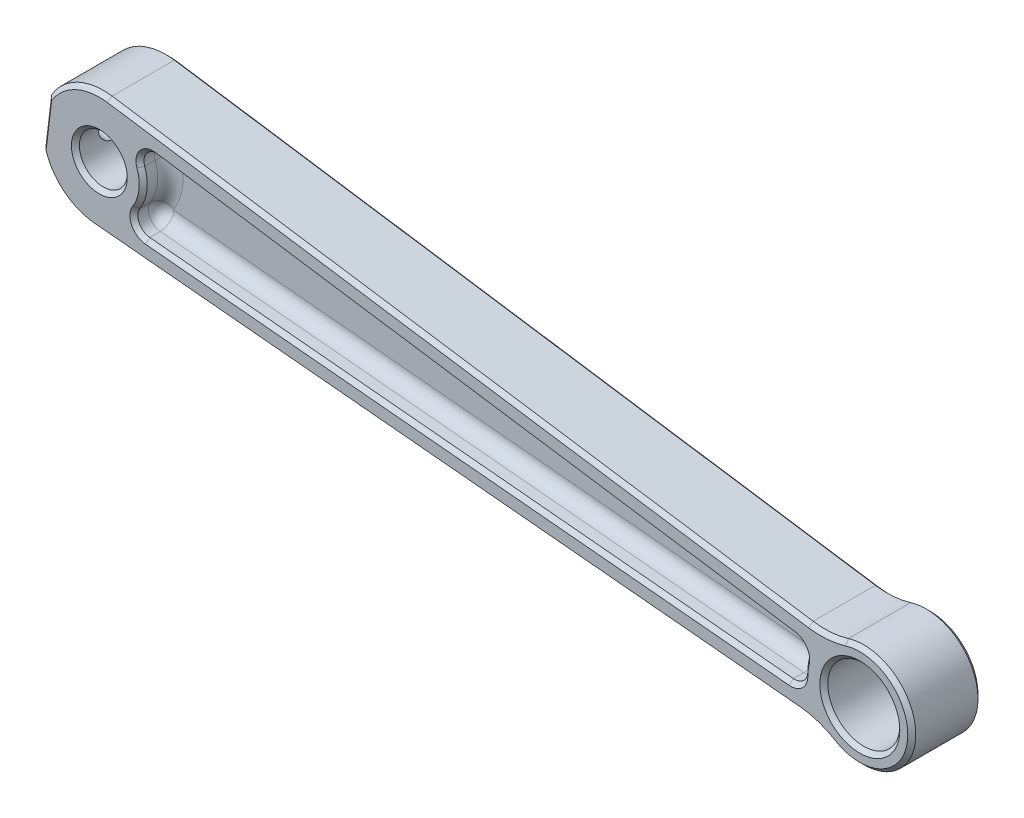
ISO-10303-21;
HEADER;
FILE_DESCRIPTION(('STEP AP214'),'2;1');
FILE_NAME('part.step','',(''),(''),'','','');
FILE_SCHEMA(('AUTOMOTIVE_DESIGN { 1 0 10303 214 1 1 1 1 }'));
ENDSEC;
DATA;
#1=APPLICATION_CONTEXT('core data for automotive mechanical design processes');
#2=APPLICATION_PROTOCOL_DEFINITION('international standard','automotive_design',2000,#1);
#3=PRODUCT_CONTEXT('',#1,'mechanical');
#4=PRODUCT('Part','Part','',(#3));
#5=PRODUCT_RELATED_PRODUCT_CATEGORY('part','',(#4));
#6=PRODUCT_DEFINITION_FORMATION('','',#4);
#7=PRODUCT_DEFINITION_CONTEXT('part definition',#1,'design');
#8=PRODUCT_DEFINITION('design','',#6,#7);
#9=PRODUCT_DEFINITION_SHAPE('','',#8);
#10=(LENGTH_UNIT() NAMED_UNIT(*) SI_UNIT(.MILLI.,.METRE.));
#11=(NAMED_UNIT(*) PLANE_ANGLE_UNIT() SI_UNIT($,.RADIAN.));
#12=(NAMED_UNIT(*) SI_UNIT($,.STERADIAN.) SOLID_ANGLE_UNIT());
#13=UNCERTAINTY_MEASURE_WITH_UNIT(LENGTH_MEASURE(1.E-05),#10,'distance_accuracy_value','');
#14=(GEOMETRIC_REPRESENTATION_CONTEXT(3) GLOBAL_UNCERTAINTY_ASSIGNED_CONTEXT((#13)) GLOBAL_UNIT_ASSIGNED_CONTEXT((#10,
#11,#12)) REPRESENTATION_CONTEXT('',''));
#15=CARTESIAN_POINT('',(0.,0.,0.));
#16=DIRECTION('',(0.,0.,1.));
#17=DIRECTION('',(1.,0.,0.));
#18=AXIS2_PLACEMENT_3D('',#15,#16,#17);
#19=CARTESIAN_POINT('',(10.8026579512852,-56.8427786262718,29.8));
#20=DIRECTION('',(0.,0.,1.));
#21=DIRECTION('',(1.,0.,0.));
#22=AXIS2_PLACEMENT_3D('',#19,#20,#21);
#23=PLANE('',#22);
#24=DIRECTION('',(-0.995654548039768,0.0931236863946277,0.));
#25=VECTOR('',#24,1.);
#26=CARTESIAN_POINT('',(10.2904776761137,-62.3188786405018,29.8));
#27=LINE('',#26,#25);
#28=CARTESIAN_POINT('',(97.2440539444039,-70.4516568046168,29.8));
#29=VERTEX_POINT('',#28);
#30=CARTESIAN_POINT('',(16.5796736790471,-62.9071078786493,29.8));
#31=VERTEX_POINT('',#30);
#32=EDGE_CURVE('E533',#29,#31,#27,.T.);
#33=ORIENTED_EDGE('',*,*,#32,.T.);
#34=CARTESIAN_POINT('',(16.7798896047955,-60.7664506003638,29.8));
#35=DIRECTION('',(0.,0.,1.));
#36=DIRECTION('',(1.,0.,0.));
#37=AXIS2_PLACEMENT_3D('',#34,#35,#36);
#38=CIRCLE('',#37,2.15000000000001);
#39=CARTESIAN_POINT('',(14.9825402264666,-59.5866051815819,29.8));
#40=VERTEX_POINT('',#39);
#41=EDGE_CURVE('E535',#31,#40,#38,.F.);
#42=ORIENTED_EDGE('',*,*,#41,.T.);
#43=CARTESIAN_POINT('',(10.8026579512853,-56.8427786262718,29.8));
#44=DIRECTION('',(0.,0.,1.));
#45=DIRECTION('',(1.,0.,0.));
#46=AXIS2_PLACEMENT_3D('',#43,#44,#45);
#47=CIRCLE('',#46,4.99999999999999);
#48=CARTESIAN_POINT('',(15.5165759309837,-55.1757521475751,29.8));
#49=VERTEX_POINT('',#48);
#50=EDGE_CURVE('E521',#40,#49,#47,.T.);
#51=ORIENTED_EDGE('',*,*,#50,.T.);
#52=CARTESIAN_POINT('',(17.5435606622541,-54.4589307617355,29.8));
#53=DIRECTION('',(0.,0.,1.));
#54=DIRECTION('',(1.,0.,0.));
#55=AXIS2_PLACEMENT_3D('',#52,#53,#54);
#56=CIRCLE('',#55,2.15);
#57=CARTESIAN_POINT('',(17.8599932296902,-52.3323441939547,29.8));
#58=VERTEX_POINT('',#57);
#59=EDGE_CURVE('E523',#49,#58,#56,.F.);
#60=ORIENTED_EDGE('',*,*,#59,.T.);
#61=DIRECTION('',(0.989110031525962,-0.14717793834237,0.));
#62=VECTOR('',#61,1.);
#63=CARTESIAN_POINT('',(11.6121366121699,-51.4026734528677,29.8));
#64=LINE('',#63,#62);
#65=CARTESIAN_POINT('',(97.994160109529,-64.2561758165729,29.8));
#66=VERTEX_POINT('',#65);
#67=EDGE_CURVE('E525',#58,#66,#64,.T.);
#68=ORIENTED_EDGE('',*,*,#67,.T.);
#69=CARTESIAN_POINT('',(97.6777275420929,-66.3827623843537,29.8));
#70=DIRECTION('',(0.,0.,1.));
#71=DIRECTION('',(1.,0.,0.));
#72=AXIS2_PLACEMENT_3D('',#69,#70,#71);
#73=CIRCLE('',#72,2.15);
#74=CARTESIAN_POINT('',(99.7697142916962,-66.8788384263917,29.8));
#75=VERTEX_POINT('',#74);
#76=EDGE_CURVE('E527',#66,#75,#73,.F.);
#77=ORIENTED_EDGE('',*,*,#76,.T.);
#78=CARTESIAN_POINT('',(106.106682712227,-68.3815335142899,29.8));
#79=DIRECTION('',(0.,0.,1.));
#80=DIRECTION('',(1.,0.,0.));
#81=AXIS2_PLACEMENT_3D('',#78,#79,#80);
#82=CIRCLE('',#81,6.5127);
#83=CARTESIAN_POINT('',(99.5941986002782,-68.3285053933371,29.8));
#84=VERTEX_POINT('',#83);
#85=EDGE_CURVE('E529',#75,#84,#82,.T.);
#86=ORIENTED_EDGE('',*,*,#85,.T.);
#87=CARTESIAN_POINT('',(97.4442698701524,-68.3109995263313,29.8));
#88=DIRECTION('',(0.,0.,1.));
#89=DIRECTION('',(1.,0.,0.));
#90=AXIS2_PLACEMENT_3D('',#87,#88,#89);
#91=CIRCLE('',#90,2.15);
#92=EDGE_CURVE('E531',#84,#29,#91,.F.);
#93=ORIENTED_EDGE('',*,*,#92,.T.);
#94=EDGE_LOOP('',(#33,#42,#51,#60,#68,#77,#86,#93));
#95=FACE_BOUND('',#94,.T.);
#96=CARTESIAN_POINT('',(10.8026579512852,-56.8427786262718,29.8));
#97=DIRECTION('',(0.,0.,1.));
#98=DIRECTION('',(1.,0.,0.));
#99=AXIS2_PLACEMENT_3D('',#96,#97,#98);
#100=CIRCLE('',#99,6.99999999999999);
#101=CARTESIAN_POINT('',(11.8329035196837,-49.9190084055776,29.8));
#102=VERTEX_POINT('',#101);
#103=CARTESIAN_POINT('',(4.82282015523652,-53.2038859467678,29.8));
#104=VERTEX_POINT('',#103);
#105=EDGE_CURVE('E516',#102,#104,#100,.T.);
#106=ORIENTED_EDGE('',*,*,#105,.T.);
#107=DIRECTION('',(-0.120195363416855,-0.992750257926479,0.));
#108=VECTOR('',#107,1.);
#109=CARTESIAN_POINT('',(4.11441718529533,-59.0549205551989,29.8));
#110=LINE('',#109,#108);
#111=CARTESIAN_POINT('',(4.12718639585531,-58.9494536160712,29.8));
#112=VERTEX_POINT('',#111);
#113=EDGE_CURVE('E518',#104,#112,#110,.T.);
#114=ORIENTED_EDGE('',*,*,#113,.T.);
#115=CARTESIAN_POINT('',(10.8026579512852,-56.8427786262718,29.8));
#116=DIRECTION('',(0.,0.,1.));
#117=DIRECTION('',(1.,0.,0.));
#118=AXIS2_PLACEMENT_3D('',#115,#116,#117);
#119=CIRCLE('',#118,7.);
#120=CARTESIAN_POINT('',(10.1507921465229,-63.8123604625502,29.8));
#121=VERTEX_POINT('',#120);
#122=EDGE_CURVE('E504',#112,#121,#119,.T.);
#123=ORIENTED_EDGE('',*,*,#122,.T.);
#124=DIRECTION('',(0.995654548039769,-0.0931236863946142,0.));
#125=VECTOR('',#124,1.);
#126=CARTESIAN_POINT('',(98.5834201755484,-72.0834745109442,29.8));
#127=LINE('',#126,#125);
#128=CARTESIAN_POINT('',(98.5834201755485,-72.0834745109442,29.8));
#129=VERTEX_POINT('',#128);
#130=EDGE_CURVE('E506',#121,#129,#127,.T.);
#131=ORIENTED_EDGE('',*,*,#130,.T.);
#132=CARTESIAN_POINT('',(97.605621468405,-82.5378472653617,29.8));
#133=DIRECTION('',(0.,0.,1.));
#134=DIRECTION('',(1.,0.,0.));
#135=AXIS2_PLACEMENT_3D('',#132,#133,#134);
#136=CIRCLE('',#135,10.5);
#137=CARTESIAN_POINT('',(103.011227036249,-73.5362125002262,29.8));
#138=VERTEX_POINT('',#137);
#139=EDGE_CURVE('E508',#129,#138,#136,.F.);
#140=ORIENTED_EDGE('',*,*,#139,.T.);
#141=CARTESIAN_POINT('',(106.106682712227,-68.3815335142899,29.8));
#142=DIRECTION('',(0.,0.,1.));
#143=DIRECTION('',(1.,0.,0.));
#144=AXIS2_PLACEMENT_3D('',#141,#142,#143);
#145=CIRCLE('',#144,6.01270000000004);
#146=CARTESIAN_POINT('',(104.330820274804,-62.637068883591,29.8));
#147=VERTEX_POINT('',#146);
#148=EDGE_CURVE('E510',#138,#147,#145,.T.);
#149=ORIENTED_EDGE('',*,*,#148,.T.);
#150=CARTESIAN_POINT('',(101.229625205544,-52.6054892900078,29.8));
#151=DIRECTION('',(0.,0.,1.));
#152=DIRECTION('',(1.,0.,0.));
#153=AXIS2_PLACEMENT_3D('',#150,#151,#152);
#154=CIRCLE('',#153,10.5);
#155=CARTESIAN_POINT('',(99.6842568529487,-62.9911446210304,29.8));
#156=VERTEX_POINT('',#155);
#157=EDGE_CURVE('E512',#147,#156,#154,.F.);
#158=ORIENTED_EDGE('',*,*,#157,.T.);
#159=DIRECTION('',(-0.98911003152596,0.147177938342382,0.));
#160=VECTOR('',#159,1.);
#161=CARTESIAN_POINT('',(11.8329035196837,-49.9190084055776,29.8));
#162=LINE('',#161,#160);
#163=EDGE_CURVE('E514',#156,#102,#162,.T.);
#164=ORIENTED_EDGE('',*,*,#163,.T.);
#165=EDGE_LOOP('',(#106,#114,#123,#131,#140,#149,#158,#164));
#166=FACE_BOUND('',#165,.T.);
#167=CARTESIAN_POINT('',(10.8026579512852,-56.8427786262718,29.8));
#168=DIRECTION('',(0.,0.,1.));
#169=DIRECTION('',(1.,0.,0.));
#170=AXIS2_PLACEMENT_3D('',#167,#168,#169);
#171=CIRCLE('',#170,3.49999999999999);
#172=CARTESIAN_POINT('',(14.3026579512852,-56.8427786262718,29.8));
#173=VERTEX_POINT('',#172);
#174=EDGE_CURVE('E501',#173,#173,#171,.F.);
#175=ORIENTED_EDGE('',*,*,#174,.T.);
#176=EDGE_LOOP('',(#175));
#177=FACE_BOUND('',#176,.T.);
#178=CARTESIAN_POINT('',(106.106682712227,-68.3815335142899,29.8));
#179=DIRECTION('',(0.,0.,1.));
#180=DIRECTION('',(1.,0.,0.));
#181=AXIS2_PLACEMENT_3D('',#178,#179,#180);
#182=CIRCLE('',#181,5.01270000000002);
#183=CARTESIAN_POINT('',(111.119382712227,-68.3815335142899,29.8));
#184=VERTEX_POINT('',#183);
#185=EDGE_CURVE('E498',#184,#184,#182,.F.);
#186=ORIENTED_EDGE('',*,*,#185,.T.);
#187=EDGE_LOOP('',(#186));
#188=FACE_BOUND('',#187,.T.);
#189=ADVANCED_FACE('F35',(#95,#166,#177,#188),#23,.T.);
#190=CARTESIAN_POINT('',(10.8026579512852,-56.8427786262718,29.8));
#191=DIRECTION('',(0.,0.,-1.));
#192=DIRECTION('',(-1.,0.,0.));
#193=AXIS2_PLACEMENT_3D('',#190,#191,#192);
#194=CYLINDRICAL_SURFACE('',#193,7.49999999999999);
#195=DIRECTION('',(0.,0.,-1.));
#196=VECTOR('',#195,1.);
#197=CARTESIAN_POINT('',(10.1042303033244,-64.3101877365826,29.8));
#198=LINE('',#197,#196);
#199=CARTESIAN_POINT('',(10.1042303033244,-64.3101877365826,29.3));
#200=VERTEX_POINT('',#199);
#201=CARTESIAN_POINT('',(10.1042303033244,-64.3101877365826,21.5));
#202=VERTEX_POINT('',#201);
#203=EDGE_CURVE('E1002',#200,#202,#198,.T.);
#204=ORIENTED_EDGE('',*,*,#203,.F.);
#205=CARTESIAN_POINT('',(10.8026579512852,-56.8427786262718,29.3));
#206=DIRECTION('',(0.,0.,1.));
#207=DIRECTION('',(1.,0.,0.));
#208=AXIS2_PLACEMENT_3D('',#205,#206,#207);
#209=CIRCLE('',#208,7.49999999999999);
#210=CARTESIAN_POINT('',(3.6180420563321,-58.9948228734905,29.3));
#211=VERTEX_POINT('',#210);
#212=EDGE_CURVE('E584',#200,#211,#209,.F.);
#213=ORIENTED_EDGE('',*,*,#212,.T.);
#214=DIRECTION('',(0.,0.,-1.));
#215=VECTOR('',#214,1.);
#216=CARTESIAN_POINT('',(3.6180420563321,-58.9948228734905,29.8));
#217=LINE('',#216,#215);
#218=CARTESIAN_POINT('',(3.6180420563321,-58.9948228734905,21.5));
#219=VERTEX_POINT('',#218);
#220=EDGE_CURVE('E1005',#211,#219,#217,.T.);
#221=ORIENTED_EDGE('',*,*,#220,.T.);
#222=CARTESIAN_POINT('',(10.8026579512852,-56.8427786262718,21.5));
#223=DIRECTION('',(0.,0.,1.));
#224=DIRECTION('',(1.,0.,0.));
#225=AXIS2_PLACEMENT_3D('',#222,#223,#224);
#226=CIRCLE('',#225,7.49999999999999);
#227=EDGE_CURVE('E582',#219,#202,#226,.T.);
#228=ORIENTED_EDGE('',*,*,#227,.T.);
#229=EDGE_LOOP('',(#204,#213,#221,#228));
#230=FACE_BOUND('',#229,.T.);
#231=ADVANCED_FACE('F808',(#230),#194,.T.);
#232=CARTESIAN_POINT('',(10.8026579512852,-56.8427786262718,21.));
#233=DIRECTION('',(0.,0.,1.));
#234=DIRECTION('',(1.,0.,0.));
#235=AXIS2_PLACEMENT_3D('',#232,#233,#234);
#236=PLANE('',#235);
#237=CARTESIAN_POINT('',(10.8026579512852,-56.8427786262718,21.));
#238=DIRECTION('',(0.,0.,1.));
#239=DIRECTION('',(1.,0.,0.));
#240=AXIS2_PLACEMENT_3D('',#237,#238,#239);
#241=CIRCLE('',#240,3.50000000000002);
#242=CARTESIAN_POINT('',(14.3026579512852,-56.8427786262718,21.));
#243=VERTEX_POINT('',#242);
#244=EDGE_CURVE('E629',#243,#243,#241,.T.);
#245=ORIENTED_EDGE('',*,*,#244,.T.);
#246=EDGE_LOOP('',(#245));
#247=FACE_BOUND('',#246,.T.);
#248=CARTESIAN_POINT('',(97.4442698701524,-68.3109995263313,21.));
#249=DIRECTION('',(0.,0.,1.));
#250=DIRECTION('',(1.,0.,0.));
#251=AXIS2_PLACEMENT_3D('',#248,#249,#250);
#252=CIRCLE('',#251,2.14999999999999);
#253=CARTESIAN_POINT('',(97.2440539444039,-70.4516568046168,21.));
#254=VERTEX_POINT('',#253);
#255=CARTESIAN_POINT('',(99.5941986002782,-68.3285053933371,21.));
#256=VERTEX_POINT('',#255);
#257=EDGE_CURVE('E622',#254,#256,#252,.T.);
#258=ORIENTED_EDGE('',*,*,#257,.T.);
#259=CARTESIAN_POINT('',(106.106682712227,-68.3815335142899,21.));
#260=DIRECTION('',(0.,0.,1.));
#261=DIRECTION('',(1.,0.,0.));
#262=AXIS2_PLACEMENT_3D('',#259,#260,#261);
#263=CIRCLE('',#262,6.51270000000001);
#264=CARTESIAN_POINT('',(99.7697142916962,-66.8788384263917,21.));
#265=VERTEX_POINT('',#264);
#266=EDGE_CURVE('E626',#256,#265,#263,.F.);
#267=ORIENTED_EDGE('',*,*,#266,.T.);
#268=CARTESIAN_POINT('',(97.6777275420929,-66.3827623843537,21.));
#269=DIRECTION('',(0.,0.,1.));
#270=DIRECTION('',(1.,0.,0.));
#271=AXIS2_PLACEMENT_3D('',#268,#269,#270);
#272=CIRCLE('',#271,2.14999999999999);
#273=CARTESIAN_POINT('',(97.994160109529,-64.2561758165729,21.));
#274=VERTEX_POINT('',#273);
#275=EDGE_CURVE('E624',#265,#274,#272,.T.);
#276=ORIENTED_EDGE('',*,*,#275,.T.);
#277=DIRECTION('',(-0.989110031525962,0.14717793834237,0.));
#278=VECTOR('',#277,1.);
#279=CARTESIAN_POINT('',(11.6121366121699,-51.4026734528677,21.));
#280=LINE('',#279,#278);
#281=CARTESIAN_POINT('',(17.8599932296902,-52.3323441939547,21.));
#282=VERTEX_POINT('',#281);
#283=EDGE_CURVE('E620',#274,#282,#280,.T.);
#284=ORIENTED_EDGE('',*,*,#283,.T.);
#285=CARTESIAN_POINT('',(17.5435606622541,-54.4589307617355,21.));
#286=DIRECTION('',(0.,0.,1.));
#287=DIRECTION('',(1.,0.,0.));
#288=AXIS2_PLACEMENT_3D('',#285,#286,#287);
#289=CIRCLE('',#288,2.14999999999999);
#290=CARTESIAN_POINT('',(15.5165759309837,-55.1757521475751,21.));
#291=VERTEX_POINT('',#290);
#292=EDGE_CURVE('E616',#282,#291,#289,.T.);
#293=ORIENTED_EDGE('',*,*,#292,.T.);
#294=CARTESIAN_POINT('',(10.8026579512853,-56.8427786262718,21.));
#295=DIRECTION('',(0.,0.,1.));
#296=DIRECTION('',(1.,0.,0.));
#297=AXIS2_PLACEMENT_3D('',#294,#295,#296);
#298=CIRCLE('',#297,5.00000000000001);
#299=CARTESIAN_POINT('',(14.9825402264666,-59.5866051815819,21.));
#300=VERTEX_POINT('',#299);
#301=EDGE_CURVE('E612',#291,#300,#298,.F.);
#302=ORIENTED_EDGE('',*,*,#301,.T.);
#303=CARTESIAN_POINT('',(16.7798896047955,-60.7664506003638,21.));
#304=DIRECTION('',(0.,0.,1.));
#305=DIRECTION('',(1.,0.,0.));
#306=AXIS2_PLACEMENT_3D('',#303,#304,#305);
#307=CIRCLE('',#306,2.14999999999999);
#308=CARTESIAN_POINT('',(16.5796736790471,-62.9071078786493,21.));
#309=VERTEX_POINT('',#308);
#310=EDGE_CURVE('E614',#300,#309,#307,.T.);
#311=ORIENTED_EDGE('',*,*,#310,.T.);
#312=DIRECTION('',(0.995654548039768,-0.0931236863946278,0.));
#313=VECTOR('',#312,1.);
#314=CARTESIAN_POINT('',(10.2904776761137,-62.3188786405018,21.));
#315=LINE('',#314,#313);
#316=EDGE_CURVE('E618',#309,#254,#315,.T.);
#317=ORIENTED_EDGE('',*,*,#316,.T.);
#318=EDGE_LOOP('',(#258,#267,#276,#284,#293,#302,#311,#317));
#319=FACE_BOUND('',#318,.T.);
#320=CARTESIAN_POINT('',(10.8026579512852,-56.8427786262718,21.));
#321=DIRECTION('',(0.,0.,1.));
#322=DIRECTION('',(1.,0.,0.));
#323=AXIS2_PLACEMENT_3D('',#320,#321,#322);
#324=CIRCLE('',#323,6.99999999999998);
#325=CARTESIAN_POINT('',(10.1507921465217,-63.8123604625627,21.));
#326=VERTEX_POINT('',#325);
#327=CARTESIAN_POINT('',(4.12718639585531,-58.9494536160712,21.));
#328=VERTEX_POINT('',#327);
#329=EDGE_CURVE('E607',#326,#328,#324,.F.);
#330=ORIENTED_EDGE('',*,*,#329,.T.);
#331=DIRECTION('',(0.120195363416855,0.992750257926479,0.));
#332=VECTOR('',#331,1.);
#333=CARTESIAN_POINT('',(4.4750032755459,-56.0766697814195,21.));
#334=LINE('',#333,#332);
#335=CARTESIAN_POINT('',(4.82282015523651,-53.2038859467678,21.));
#336=VERTEX_POINT('',#335);
#337=EDGE_CURVE('E609',#328,#336,#334,.T.);
#338=ORIENTED_EDGE('',*,*,#337,.T.);
#339=CARTESIAN_POINT('',(10.8026579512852,-56.8427786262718,21.));
#340=DIRECTION('',(0.,0.,1.));
#341=DIRECTION('',(1.,0.,0.));
#342=AXIS2_PLACEMENT_3D('',#339,#340,#341);
#343=CIRCLE('',#342,6.99999999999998);
#344=CARTESIAN_POINT('',(11.8329035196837,-49.9190084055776,21.));
#345=VERTEX_POINT('',#344);
#346=EDGE_CURVE('E597',#336,#345,#343,.F.);
#347=ORIENTED_EDGE('',*,*,#346,.T.);
#348=DIRECTION('',(0.98911003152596,-0.147177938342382,0.));
#349=VECTOR('',#348,1.);
#350=CARTESIAN_POINT('',(11.8329035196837,-49.9190084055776,21.));
#351=LINE('',#350,#349);
#352=CARTESIAN_POINT('',(99.6842568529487,-62.9911446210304,21.));
#353=VERTEX_POINT('',#352);
#354=EDGE_CURVE('E595',#345,#353,#351,.T.);
#355=ORIENTED_EDGE('',*,*,#354,.T.);
#356=CARTESIAN_POINT('',(101.229625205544,-52.6054892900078,21.));
#357=DIRECTION('',(0.,0.,1.));
#358=DIRECTION('',(1.,0.,0.));
#359=AXIS2_PLACEMENT_3D('',#356,#357,#358);
#360=CIRCLE('',#359,10.5);
#361=CARTESIAN_POINT('',(104.330820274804,-62.637068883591,21.));
#362=VERTEX_POINT('',#361);
#363=EDGE_CURVE('E599',#353,#362,#360,.T.);
#364=ORIENTED_EDGE('',*,*,#363,.T.);
#365=CARTESIAN_POINT('',(106.106682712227,-68.3815335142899,21.));
#366=DIRECTION('',(0.,0.,1.));
#367=DIRECTION('',(1.,0.,0.));
#368=AXIS2_PLACEMENT_3D('',#365,#366,#367);
#369=CIRCLE('',#368,6.01270000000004);
#370=CARTESIAN_POINT('',(103.011227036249,-73.5362125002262,21.));
#371=VERTEX_POINT('',#370);
#372=EDGE_CURVE('E601',#362,#371,#369,.F.);
#373=ORIENTED_EDGE('',*,*,#372,.T.);
#374=CARTESIAN_POINT('',(97.605621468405,-82.5378472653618,21.));
#375=DIRECTION('',(0.,0.,1.));
#376=DIRECTION('',(1.,0.,0.));
#377=AXIS2_PLACEMENT_3D('',#374,#375,#376);
#378=CIRCLE('',#377,10.5);
#379=CARTESIAN_POINT('',(98.5834201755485,-72.0834745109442,21.));
#380=VERTEX_POINT('',#379);
#381=EDGE_CURVE('E603',#371,#380,#378,.T.);
#382=ORIENTED_EDGE('',*,*,#381,.T.);
#383=DIRECTION('',(-0.995654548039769,0.0931236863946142,0.));
#384=VECTOR('',#383,1.);
#385=CARTESIAN_POINT('',(10.1507921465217,-63.8123604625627,21.));
#386=LINE('',#385,#384);
#387=EDGE_CURVE('E605',#380,#326,#386,.T.);
#388=ORIENTED_EDGE('',*,*,#387,.T.);
#389=EDGE_LOOP('',(#330,#338,#347,#355,#364,#373,#382,#388));
#390=FACE_BOUND('',#389,.T.);
#391=CARTESIAN_POINT('',(106.106682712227,-68.3815335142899,21.));
#392=DIRECTION('',(0.,0.,1.));
#393=DIRECTION('',(0.,-1.,0.));
#394=AXIS2_PLACEMENT_3D('',#391,#392,#393);
#395=CIRCLE('',#394,3.71270000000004);
#396=CARTESIAN_POINT('',(106.106682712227,-72.0942335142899,21.));
#397=VERTEX_POINT('',#396);
#398=EDGE_CURVE('E996',#397,#397,#395,.T.);
#399=ORIENTED_EDGE('',*,*,#398,.T.);
#400=EDGE_LOOP('',(#399));
#401=FACE_BOUND('',#400,.T.);
#402=ADVANCED_FACE('F814',(#247,#319,#390,#401),#236,.F.);
#403=DIRECTION('',(0.,0.,-1.));
#404=VECTOR('',#403,1.);
#405=CARTESIAN_POINT('',(4.33921423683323,-53.0383213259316,29.8));
#406=LINE('',#405,#404);
#407=CARTESIAN_POINT('',(4.33921423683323,-53.0383213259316,29.3));
#408=VERTEX_POINT('',#407);
#409=CARTESIAN_POINT('',(4.33921423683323,-53.0383213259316,21.5));
#410=VERTEX_POINT('',#409);
#411=EDGE_CURVE('E1008',#408,#410,#406,.T.);
#412=ORIENTED_EDGE('',*,*,#411,.F.);
#413=CARTESIAN_POINT('',(10.8026579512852,-56.8427786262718,29.3));
#414=DIRECTION('',(0.,0.,1.));
#415=DIRECTION('',(1.,0.,0.));
#416=AXIS2_PLACEMENT_3D('',#413,#414,#415);
#417=CIRCLE('',#416,7.49999999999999);
#418=CARTESIAN_POINT('',(11.9064924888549,-49.4244533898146,29.3));
#419=VERTEX_POINT('',#418);
#420=EDGE_CURVE('E560',#408,#419,#417,.F.);
#421=ORIENTED_EDGE('',*,*,#420,.T.);
#422=DIRECTION('',(0.,0.,-1.));
#423=VECTOR('',#422,1.);
#424=CARTESIAN_POINT('',(11.9064924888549,-49.4244533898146,29.8));
#425=LINE('',#424,#423);
#426=CARTESIAN_POINT('',(11.9064924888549,-49.4244533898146,21.5));
#427=VERTEX_POINT('',#426);
#428=EDGE_CURVE('E999',#419,#427,#425,.T.);
#429=ORIENTED_EDGE('',*,*,#428,.T.);
#430=CARTESIAN_POINT('',(10.8026579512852,-56.8427786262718,21.5));
#431=DIRECTION('',(0.,0.,1.));
#432=DIRECTION('',(1.,0.,0.));
#433=AXIS2_PLACEMENT_3D('',#430,#431,#432);
#434=CIRCLE('',#433,7.49999999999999);
#435=EDGE_CURVE('E558',#427,#410,#434,.T.);
#436=ORIENTED_EDGE('',*,*,#435,.T.);
#437=EDGE_LOOP('',(#412,#421,#429,#436));
#438=FACE_BOUND('',#437,.T.);
#439=ADVANCED_FACE('F817',(#438),#194,.T.);
#440=CARTESIAN_POINT('',(4.33921423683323,-53.0383213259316,29.8));
#441=DIRECTION('',(0.992750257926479,-0.120195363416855,0.));
#442=DIRECTION('',(0.120195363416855,0.992750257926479,0.));
#443=AXIS2_PLACEMENT_3D('',#440,#441,#442);
#444=PLANE('',#443);
#445=CARTESIAN_POINT('',(3.97862814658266,-56.0165720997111,25.4));
#446=DIRECTION('',(-0.992750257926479,0.120195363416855,0.));
#447=DIRECTION('',(-0.120195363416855,-0.992750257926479,0.));
#448=AXIS2_PLACEMENT_3D('',#445,#446,#447);
#449=CIRCLE('',#448,1.49999999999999);
#450=CARTESIAN_POINT('',(3.79833510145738,-57.5056974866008,25.4));
#451=VERTEX_POINT('',#450);
#452=EDGE_CURVE('E978',#451,#451,#449,.T.);
#453=ORIENTED_EDGE('',*,*,#452,.F.);
#454=EDGE_LOOP('',(#453));
#455=FACE_BOUND('',#454,.T.);
#456=ORIENTED_EDGE('',*,*,#220,.F.);
#457=DIRECTION('',(0.120195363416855,0.992750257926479,0.));
#458=VECTOR('',#457,1.);
#459=CARTESIAN_POINT('',(4.33921423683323,-53.0383213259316,29.3));
#460=LINE('',#459,#458);
#461=EDGE_CURVE('E555',#211,#408,#460,.T.);
#462=ORIENTED_EDGE('',*,*,#461,.T.);
#463=ORIENTED_EDGE('',*,*,#411,.T.);
#464=DIRECTION('',(-0.120195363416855,-0.992750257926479,0.));
#465=VECTOR('',#464,1.);
#466=CARTESIAN_POINT('',(4.33921423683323,-53.0383213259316,21.5));
#467=LINE('',#466,#465);
#468=EDGE_CURVE('E552',#410,#219,#467,.T.);
#469=ORIENTED_EDGE('',*,*,#468,.T.);
#470=EDGE_LOOP('',(#456,#462,#463,#469));
#471=FACE_BOUND('',#470,.T.);
#472=ADVANCED_FACE('F826',(#455,#471),#444,.F.);
#473=CARTESIAN_POINT('',(10.8026579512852,-56.8427786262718,29.8));
#474=DIRECTION('',(0.,0.,-1.));
#475=DIRECTION('',(-1.,0.,0.));
#476=AXIS2_PLACEMENT_3D('',#473,#474,#475);
#477=CYLINDRICAL_SURFACE('',#476,3.);
#478=CARTESIAN_POINT('',(10.8026579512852,-56.8427786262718,29.3));
#479=DIRECTION('',(0.,0.,1.));
#480=DIRECTION('',(1.,0.,0.));
#481=AXIS2_PLACEMENT_3D('',#478,#479,#480);
#482=CIRCLE('',#481,3.);
#483=CARTESIAN_POINT('',(13.8026579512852,-56.8427786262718,29.3));
#484=VERTEX_POINT('',#483);
#485=EDGE_CURVE('E589',#484,#484,#482,.T.);
#486=ORIENTED_EDGE('',*,*,#485,.T.);
#487=EDGE_LOOP('',(#486));
#488=FACE_BOUND('',#487,.T.);
#489=CARTESIAN_POINT('',(10.8026579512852,-56.8427786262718,21.5));
#490=DIRECTION('',(0.,0.,1.));
#491=DIRECTION('',(1.,0.,0.));
#492=AXIS2_PLACEMENT_3D('',#489,#490,#491);
#493=CIRCLE('',#492,3.);
#494=CARTESIAN_POINT('',(13.8026579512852,-56.8427786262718,21.5));
#495=VERTEX_POINT('',#494);
#496=EDGE_CURVE('E586',#495,#495,#493,.F.);
#497=ORIENTED_EDGE('',*,*,#496,.T.);
#498=EDGE_LOOP('',(#497));
#499=FACE_BOUND('',#498,.T.);
#500=CARTESIAN_POINT('',(7.80265795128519,-56.8427786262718,26.8560143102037));
#501=CARTESIAN_POINT('',(7.80266157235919,-56.9246205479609,26.8358887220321));
#502=CARTESIAN_POINT('',(7.80604126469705,-57.0049201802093,26.8089945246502));
#503=CARTESIAN_POINT('',(7.81844852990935,-57.1599274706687,26.7428652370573));
#504=CARTESIAN_POINT('',(7.82749190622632,-57.2346188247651,26.7035957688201));
#505=CARTESIAN_POINT('',(7.84957774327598,-57.3760851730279,26.6143161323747));
#506=CARTESIAN_POINT('',(7.86260059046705,-57.4428968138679,26.56435899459));
#507=CARTESIAN_POINT('',(7.89082546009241,-57.5675699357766,26.4548647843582));
#508=CARTESIAN_POINT('',(7.90602728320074,-57.6254322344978,26.3953285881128));
#509=CARTESIAN_POINT('',(7.93760103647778,-57.7343319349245,26.2636759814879));
#510=CARTESIAN_POINT('',(7.95398516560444,-57.7846878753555,26.1909956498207));
#511=CARTESIAN_POINT('',(7.98437617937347,-57.8720685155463,26.0375321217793));
#512=CARTESIAN_POINT('',(7.99838379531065,-57.9090973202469,25.9567514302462));
#513=CARTESIAN_POINT('',(8.02104210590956,-57.9668556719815,25.7923458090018));
#514=CARTESIAN_POINT('',(8.02987848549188,-57.9881585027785,25.7089505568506));
#515=CARTESIAN_POINT('',(8.04125882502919,-58.0153433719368,25.5393010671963));
#516=CARTESIAN_POINT('',(8.0438104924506,-58.0212442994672,25.4530504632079));
#517=CARTESIAN_POINT('',(8.04221627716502,-58.0174919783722,25.2918154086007));
#518=CARTESIAN_POINT('',(8.03886873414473,-58.0096931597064,25.2167720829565));
#519=CARTESIAN_POINT('',(8.02753197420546,-57.9824673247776,25.0691906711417));
#520=CARTESIAN_POINT('',(8.01954147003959,-57.9630370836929,24.9966532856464));
#521=CARTESIAN_POINT('',(8.00011374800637,-57.9135004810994,24.855915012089));
#522=CARTESIAN_POINT('',(7.98867888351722,-57.8834014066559,24.7877112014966));
#523=CARTESIAN_POINT('',(7.9638463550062,-57.8136124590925,24.6568010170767));
#524=CARTESIAN_POINT('',(7.95044791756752,-57.7739188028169,24.5940968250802));
#525=CARTESIAN_POINT('',(7.9215366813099,-57.6805204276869,24.467747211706));
#526=CARTESIAN_POINT('',(7.90596738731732,-57.6256898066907,24.4049452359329));
#527=CARTESIAN_POINT('',(7.87636650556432,-57.5065465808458,24.2886041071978));
#528=CARTESIAN_POINT('',(7.86233580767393,-57.4422285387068,24.2350703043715));
#529=CARTESIAN_POINT('',(7.8369380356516,-57.3010086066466,24.1353593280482));
#530=CARTESIAN_POINT('',(7.825804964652,-57.2235590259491,24.0898915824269));
#531=CARTESIAN_POINT('',(7.80954108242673,-57.0615480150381,24.0125825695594));
#532=CARTESIAN_POINT('',(7.8044062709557,-56.9769913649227,23.9807322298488));
#533=CARTESIAN_POINT('',(7.80175813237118,-56.8096555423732,23.9339085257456));
#534=CARTESIAN_POINT('',(7.80372961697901,-56.7271763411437,23.91789754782));
#535=CARTESIAN_POINT('',(7.81474785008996,-56.5611837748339,23.8997882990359));
#536=CARTESIAN_POINT('',(7.82379037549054,-56.4776710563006,23.8976817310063));
#537=CARTESIAN_POINT('',(7.84761881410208,-56.3197413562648,23.9070442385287));
#538=CARTESIAN_POINT('',(7.86183620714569,-56.2451654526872,23.9173474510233));
#539=CARTESIAN_POINT('',(7.89520725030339,-56.0996049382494,23.9491476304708));
#540=CARTESIAN_POINT('',(7.91436125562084,-56.0286205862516,23.970645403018));
#541=CARTESIAN_POINT('',(7.95673275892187,-55.8909523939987,24.0243586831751));
#542=CARTESIAN_POINT('',(7.98000223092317,-55.8243406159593,24.0567167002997));
#543=CARTESIAN_POINT('',(8.02895898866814,-55.6976976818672,24.1310334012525));
#544=CARTESIAN_POINT('',(8.05464713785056,-55.6376688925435,24.1729955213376));
#545=CARTESIAN_POINT('',(8.10930703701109,-55.5197236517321,24.2698832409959));
#546=CARTESIAN_POINT('',(8.13835972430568,-55.462542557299,24.3256590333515));
#547=CARTESIAN_POINT('',(8.19521675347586,-55.3579207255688,24.4463183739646));
#548=CARTESIAN_POINT('',(8.22302012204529,-55.3104874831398,24.5112088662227));
#549=CARTESIAN_POINT('',(8.27662372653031,-55.2235426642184,24.6533108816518));
#550=CARTESIAN_POINT('',(8.30218379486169,-55.1847275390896,24.7310437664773));
#551=CARTESIAN_POINT('',(8.3461102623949,-55.1203069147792,24.8936797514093));
#552=CARTESIAN_POINT('',(8.36448413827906,-55.0946876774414,24.9785752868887));
#553=CARTESIAN_POINT('',(8.39029807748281,-55.0592516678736,25.1460697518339));
#554=CARTESIAN_POINT('',(8.39848762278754,-55.0483458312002,25.2283197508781));
#555=CARTESIAN_POINT('',(8.40528023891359,-55.0392764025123,25.3938894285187));
#556=CARTESIAN_POINT('',(8.40389011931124,-55.0411037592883,25.4772083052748));
#557=CARTESIAN_POINT('',(8.39243454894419,-55.0564724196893,25.63281965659));
#558=CARTESIAN_POINT('',(8.38333592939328,-55.0687088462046,25.7053203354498));
#559=CARTESIAN_POINT('',(8.35878717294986,-55.1026833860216,25.84693209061));
#560=CARTESIAN_POINT('',(8.34333497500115,-55.1244245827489,25.9160420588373));
#561=CARTESIAN_POINT('',(8.30676513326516,-55.177962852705,26.0525353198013));
#562=CARTESIAN_POINT('',(8.28541927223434,-55.2101770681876,26.1196923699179));
#563=CARTESIAN_POINT('',(8.2393173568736,-55.2835602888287,26.2476442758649));
#564=CARTESIAN_POINT('',(8.21455953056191,-55.3247339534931,26.3084357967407));
#565=CARTESIAN_POINT('',(8.16024820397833,-55.4211250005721,26.4299517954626));
#566=CARTESIAN_POINT('',(8.13048367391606,-55.4774586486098,26.4897008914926));
#567=CARTESIAN_POINT('',(8.07143434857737,-55.5997866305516,26.5986689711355));
#568=CARTESIAN_POINT('',(8.04214968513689,-55.6657835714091,26.6478851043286));
#569=CARTESIAN_POINT('',(7.98563598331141,-55.8081769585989,26.7354966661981));
#570=CARTESIAN_POINT('',(7.95848174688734,-55.8848021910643,26.7735716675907));
#571=CARTESIAN_POINT('',(7.90941280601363,-56.0451935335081,26.8354712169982));
#572=CARTESIAN_POINT('',(7.88749566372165,-56.1289562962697,26.8593024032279));
#573=CARTESIAN_POINT('',(7.85237141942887,-56.2930457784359,26.8899736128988));
#574=CARTESIAN_POINT('',(7.83855319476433,-56.3729915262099,26.8981624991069));
#575=CARTESIAN_POINT('',(7.81750488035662,-56.5338928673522,26.9012776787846));
#576=CARTESIAN_POINT('',(7.81026008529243,-56.6148457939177,26.8962336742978));
#577=CARTESIAN_POINT('',(7.80507678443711,-56.7197561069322,26.8811857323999));
#578=CARTESIAN_POINT('',(7.80416587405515,-56.7445235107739,26.8770001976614));
#579=CARTESIAN_POINT('',(7.80295598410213,-56.7938324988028,26.8674149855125));
#580=CARTESIAN_POINT('',(7.8026568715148,-56.8183741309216,26.8620155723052));
#581=CARTESIAN_POINT('',(7.80265795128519,-56.8427786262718,26.8560143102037));
#582=B_SPLINE_CURVE_WITH_KNOTS('',3,(#500,#501,#502,#503,#504,#505,#506,#507,#508,#509,#510,
#511,#512,#513,#514,#515,#516,#517,#518,#519,#520,#521,#522,#523,#524,#525,#526,#527,#528,#529,
#530,#531,#532,#533,#534,#535,#536,#537,#538,#539,#540,#541,#542,#543,#544,#545,#546,#547,#548,
#549,#550,#551,#552,#553,#554,#555,#556,#557,#558,#559,#560,#561,#562,#563,#564,#565,#566,#567,
#568,#569,#570,#571,#572,#573,#574,#575,#576,#577,#578,#579,#580,#581),.UNSPECIFIED.,.T.,.F.,(4,
2,2,2,2,2,2,2,2,2,2,2,2,2,2,2,2,2,2,2,2,2,2,2,2,2,2,2,2,2,2,2,2,2,2,2,2,2,2,2,4),(0.,
0.252736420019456,0.506181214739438,0.758396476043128,1.01058868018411,1.27905670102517,
1.54744195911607,1.80548144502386,2.06320431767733,2.2886686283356,2.51419547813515,
2.73956858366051,2.96503069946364,3.21838859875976,3.47189226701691,3.74196327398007,
4.01185406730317,4.26258467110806,4.51316564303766,4.74193228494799,4.97071539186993,
5.20262631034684,5.43462033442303,5.68853208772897,5.94263834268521,6.21291973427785,
6.48291916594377,6.73157579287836,6.98005568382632,7.20132108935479,7.42265832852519,
7.65419291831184,7.88584821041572,8.14671928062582,8.40766085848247,8.67550021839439,
8.94321465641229,9.18656680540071,9.4293732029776,9.50475322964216,9.58011686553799),.UNSPECIFIED.);
#583=CARTESIAN_POINT('',(7.80265795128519,-56.8427786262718,26.8560143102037));
#584=VERTEX_POINT('',#583);
#585=EDGE_CURVE('E379',#584,#584,#582,.T.);
#586=ORIENTED_EDGE('',*,*,#585,.F.);
#587=EDGE_LOOP('',(#586));
#588=FACE_BOUND('',#587,.T.);
#589=ADVANCED_FACE('F820',(#488,#499,#588),#477,.F.);
#590=CARTESIAN_POINT('',(10.1042303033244,-64.3101877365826,29.8));
#591=DIRECTION('',(0.0931236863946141,0.995654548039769,0.));
#592=DIRECTION('',(-0.995654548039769,0.0931236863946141,0.));
#593=AXIS2_PLACEMENT_3D('',#590,#591,#592);
#594=PLANE('',#593);
#595=DIRECTION('',(0.,0.,1.));
#596=VECTOR('',#595,1.);
#597=CARTESIAN_POINT('',(98.5368583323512,-72.5813017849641,29.8));
#598=LINE('',#597,#596);
#599=CARTESIAN_POINT('',(98.5368583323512,-72.5813017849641,21.5));
#600=VERTEX_POINT('',#599);
#601=CARTESIAN_POINT('',(98.5368583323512,-72.5813017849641,29.3));
#602=VERTEX_POINT('',#601);
#603=EDGE_CURVE('E376',#600,#602,#598,.T.);
#604=ORIENTED_EDGE('',*,*,#603,.T.);
#605=DIRECTION('',(-0.995654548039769,0.0931236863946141,0.));
#606=VECTOR('',#605,1.);
#607=CARTESIAN_POINT('',(10.1042303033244,-64.3101877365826,29.3));
#608=LINE('',#607,#606);
#609=EDGE_CURVE('E580',#602,#200,#608,.T.);
#610=ORIENTED_EDGE('',*,*,#609,.T.);
#611=ORIENTED_EDGE('',*,*,#203,.T.);
#612=DIRECTION('',(0.995654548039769,-0.0931236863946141,0.));
#613=VECTOR('',#612,1.);
#614=CARTESIAN_POINT('',(10.1042303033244,-64.3101877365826,21.5));
#615=LINE('',#614,#613);
#616=EDGE_CURVE('E578',#202,#600,#615,.T.);
#617=ORIENTED_EDGE('',*,*,#616,.T.);
#618=EDGE_LOOP('',(#604,#610,#611,#617));
#619=FACE_BOUND('',#618,.T.);
#620=ADVANCED_FACE('F1021',(#619),#594,.F.);
#621=CARTESIAN_POINT('',(11.9064924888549,-49.4244533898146,29.8));
#622=DIRECTION('',(-0.147177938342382,-0.98911003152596,0.));
#623=DIRECTION('',(0.98911003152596,-0.147177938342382,0.));
#624=AXIS2_PLACEMENT_3D('',#621,#622,#623);
#625=PLANE('',#624);
#626=ORIENTED_EDGE('',*,*,#428,.F.);
#627=DIRECTION('',(0.98911003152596,-0.147177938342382,0.));
#628=VECTOR('',#627,1.);
#629=CARTESIAN_POINT('',(99.7578458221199,-62.4965896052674,29.3));
#630=LINE('',#629,#628);
#631=CARTESIAN_POINT('',(99.7578458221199,-62.4965896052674,29.3));
#632=VERTEX_POINT('',#631);
#633=EDGE_CURVE('E564',#419,#632,#630,.T.);
#634=ORIENTED_EDGE('',*,*,#633,.T.);
#635=DIRECTION('',(0.,0.,1.));
#636=VECTOR('',#635,1.);
#637=CARTESIAN_POINT('',(99.7578458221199,-62.4965896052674,29.8));
#638=LINE('',#637,#636);
#639=CARTESIAN_POINT('',(99.7578458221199,-62.4965896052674,21.5));
#640=VERTEX_POINT('',#639);
#641=EDGE_CURVE('E371',#632,#640,#638,.F.);
#642=ORIENTED_EDGE('',*,*,#641,.T.);
#643=DIRECTION('',(-0.98911003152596,0.147177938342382,0.));
#644=VECTOR('',#643,1.);
#645=CARTESIAN_POINT('',(11.9064924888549,-49.4244533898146,21.5));
#646=LINE('',#645,#644);
#647=EDGE_CURVE('E562',#640,#427,#646,.T.);
#648=ORIENTED_EDGE('',*,*,#647,.T.);
#649=EDGE_LOOP('',(#626,#634,#642,#648));
#650=FACE_BOUND('',#649,.T.);
#651=ADVANCED_FACE('F1057',(#650),#625,.F.);
#652=CARTESIAN_POINT('',(106.106682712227,-68.3815335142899,32.3));
#653=DIRECTION('',(0.,0.,1.));
#654=DIRECTION('',(0.,-1.,0.));
#655=AXIS2_PLACEMENT_3D('',#652,#653,#654);
#656=CYLINDRICAL_SURFACE('',#655,6.51270000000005);
#657=DIRECTION('',(0.,0.,1.));
#658=VECTOR('',#657,1.);
#659=CARTESIAN_POINT('',(104.183144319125,-62.1593746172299,32.3));
#660=LINE('',#659,#658);
#661=CARTESIAN_POINT('',(104.183144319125,-62.1593746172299,21.5));
#662=VERTEX_POINT('',#661);
#663=CARTESIAN_POINT('',(104.183144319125,-62.1593746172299,29.3));
#664=VERTEX_POINT('',#663);
#665=EDGE_CURVE('E1011',#662,#664,#660,.T.);
#666=ORIENTED_EDGE('',*,*,#665,.T.);
#667=CARTESIAN_POINT('',(106.106682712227,-68.3815335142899,29.3));
#668=DIRECTION('',(0.,0.,1.));
#669=DIRECTION('',(1.,0.,0.));
#670=AXIS2_PLACEMENT_3D('',#667,#668,#669);
#671=CIRCLE('',#670,6.51270000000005);
#672=CARTESIAN_POINT('',(102.753817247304,-73.9648617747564,29.3));
#673=VERTEX_POINT('',#672);
#674=EDGE_CURVE('E572',#664,#673,#671,.F.);
#675=ORIENTED_EDGE('',*,*,#674,.T.);
#676=DIRECTION('',(0.,0.,1.));
#677=VECTOR('',#676,1.);
#678=CARTESIAN_POINT('',(102.753817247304,-73.9648617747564,32.3));
#679=LINE('',#678,#677);
#680=CARTESIAN_POINT('',(102.753817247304,-73.9648617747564,21.5));
#681=VERTEX_POINT('',#680);
#682=EDGE_CURVE('E1014',#673,#681,#679,.F.);
#683=ORIENTED_EDGE('',*,*,#682,.T.);
#684=CARTESIAN_POINT('',(106.106682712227,-68.3815335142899,21.5));
#685=DIRECTION('',(0.,0.,1.));
#686=DIRECTION('',(1.,0.,0.));
#687=AXIS2_PLACEMENT_3D('',#684,#685,#686);
#688=CIRCLE('',#687,6.51270000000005);
#689=EDGE_CURVE('E570',#681,#662,#688,.T.);
#690=ORIENTED_EDGE('',*,*,#689,.T.);
#691=EDGE_LOOP('',(#666,#675,#683,#690));
#692=FACE_BOUND('',#691,.T.);
#693=ADVANCED_FACE('F1075',(#692),#656,.T.);
#694=CARTESIAN_POINT('',(106.106682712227,-68.3815335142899,32.3));
#695=DIRECTION('',(0.,0.,1.));
#696=DIRECTION('',(0.,-1.,0.));
#697=AXIS2_PLACEMENT_3D('',#694,#695,#696);
#698=CYLINDRICAL_SURFACE('',#697,3.71270000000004);
#699=CARTESIAN_POINT('',(106.106682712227,-68.3815335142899,21.8));
#700=DIRECTION('',(0.,0.,1.));
#701=DIRECTION('',(0.,-1.,0.));
#702=AXIS2_PLACEMENT_3D('',#699,#700,#701);
#703=CIRCLE('',#702,3.71270000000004);
#704=CARTESIAN_POINT('',(106.106682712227,-72.0942335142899,21.8));
#705=VERTEX_POINT('',#704);
#706=EDGE_CURVE('E993',#705,#705,#703,.T.);
#707=ORIENTED_EDGE('',*,*,#706,.T.);
#708=EDGE_LOOP('',(#707));
#709=FACE_BOUND('',#708,.T.);
#710=ORIENTED_EDGE('',*,*,#398,.F.);
#711=EDGE_LOOP('',(#710));
#712=FACE_BOUND('',#711,.T.);
#713=ADVANCED_FACE('F1176',(#709,#712),#698,.F.);
#714=CARTESIAN_POINT('',(105.150816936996,-63.9712294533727,21.8));
#715=DIRECTION('',(0.,0.,1.));
#716=DIRECTION('',(0.,-1.,0.));
#717=AXIS2_PLACEMENT_3D('',#714,#715,#716);
#718=PLANE('',#717);
#719=CARTESIAN_POINT('',(106.106682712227,-68.3815335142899,21.8));
#720=DIRECTION('',(0.,0.,1.));
#721=DIRECTION('',(0.,-1.,0.));
#722=AXIS2_PLACEMENT_3D('',#719,#720,#721);
#723=CIRCLE('',#722,4.51270000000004);
#724=CARTESIAN_POINT('',(106.106682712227,-72.8942335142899,21.8));
#725=VERTEX_POINT('',#724);
#726=EDGE_CURVE('E990',#725,#725,#723,.T.);
#727=ORIENTED_EDGE('',*,*,#726,.T.);
#728=EDGE_LOOP('',(#727));
#729=FACE_BOUND('',#728,.T.);
#730=ORIENTED_EDGE('',*,*,#706,.F.);
#731=EDGE_LOOP('',(#730));
#732=FACE_BOUND('',#731,.T.);
#733=ADVANCED_FACE('F1178',(#729,#732),#718,.T.);
#734=CARTESIAN_POINT('',(106.106682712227,-68.3815335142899,32.3));
#735=DIRECTION('',(0.,0.,1.));
#736=DIRECTION('',(0.,-1.,0.));
#737=AXIS2_PLACEMENT_3D('',#734,#735,#736);
#738=CYLINDRICAL_SURFACE('',#737,4.51270000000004);
#739=CARTESIAN_POINT('',(106.106682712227,-68.3815335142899,29.3));
#740=DIRECTION('',(0.,0.,1.));
#741=DIRECTION('',(1.,0.,0.));
#742=AXIS2_PLACEMENT_3D('',#739,#740,#741);
#743=CIRCLE('',#742,4.51270000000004);
#744=CARTESIAN_POINT('',(110.619382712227,-68.3815335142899,29.3));
#745=VERTEX_POINT('',#744);
#746=EDGE_CURVE('E592',#745,#745,#743,.T.);
#747=ORIENTED_EDGE('',*,*,#746,.T.);
#748=EDGE_LOOP('',(#747));
#749=FACE_BOUND('',#748,.T.);
#750=ORIENTED_EDGE('',*,*,#726,.F.);
#751=EDGE_LOOP('',(#750));
#752=FACE_BOUND('',#751,.T.);
#753=ADVANCED_FACE('F836',(#749,#752),#738,.F.);
#754=CARTESIAN_POINT('',(97.605621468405,-82.5378472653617,32.3));
#755=DIRECTION('',(0.,0.,1.));
#756=DIRECTION('',(0.,-1.,0.));
#757=AXIS2_PLACEMENT_3D('',#754,#755,#756);
#758=CYLINDRICAL_SURFACE('',#757,10.);
#759=ORIENTED_EDGE('',*,*,#682,.F.);
#760=CARTESIAN_POINT('',(97.605621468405,-82.5378472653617,29.3));
#761=DIRECTION('',(0.,0.,1.));
#762=DIRECTION('',(1.,0.,0.));
#763=AXIS2_PLACEMENT_3D('',#760,#761,#762);
#764=CIRCLE('',#763,10.);
#765=EDGE_CURVE('E576',#673,#602,#764,.T.);
#766=ORIENTED_EDGE('',*,*,#765,.T.);
#767=ORIENTED_EDGE('',*,*,#603,.F.);
#768=CARTESIAN_POINT('',(97.605621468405,-82.5378472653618,21.5));
#769=DIRECTION('',(0.,0.,1.));
#770=DIRECTION('',(1.,0.,0.));
#771=AXIS2_PLACEMENT_3D('',#768,#769,#770);
#772=CIRCLE('',#771,10.);
#773=EDGE_CURVE('E574',#600,#681,#772,.F.);
#774=ORIENTED_EDGE('',*,*,#773,.T.);
#775=EDGE_LOOP('',(#759,#766,#767,#774));
#776=FACE_BOUND('',#775,.T.);
#777=ADVANCED_FACE('F832',(#776),#758,.F.);
#778=CARTESIAN_POINT('',(101.229625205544,-52.6054892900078,32.3));
#779=DIRECTION('',(0.,0.,1.));
#780=DIRECTION('',(0.,-1.,0.));
#781=AXIS2_PLACEMENT_3D('',#778,#779,#780);
#782=CYLINDRICAL_SURFACE('',#781,10.);
#783=ORIENTED_EDGE('',*,*,#641,.F.);
#784=CARTESIAN_POINT('',(101.229625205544,-52.6054892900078,29.3));
#785=DIRECTION('',(0.,0.,1.));
#786=DIRECTION('',(1.,0.,0.));
#787=AXIS2_PLACEMENT_3D('',#784,#785,#786);
#788=CIRCLE('',#787,10.);
#789=EDGE_CURVE('E568',#632,#664,#788,.T.);
#790=ORIENTED_EDGE('',*,*,#789,.T.);
#791=ORIENTED_EDGE('',*,*,#665,.F.);
#792=CARTESIAN_POINT('',(101.229625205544,-52.6054892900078,21.5));
#793=DIRECTION('',(0.,0.,1.));
#794=DIRECTION('',(1.,0.,0.));
#795=AXIS2_PLACEMENT_3D('',#792,#793,#794);
#796=CIRCLE('',#795,10.);
#797=EDGE_CURVE('E566',#662,#640,#796,.F.);
#798=ORIENTED_EDGE('',*,*,#797,.T.);
#799=EDGE_LOOP('',(#783,#790,#791,#798));
#800=FACE_BOUND('',#799,.T.);
#801=ADVANCED_FACE('F835',(#800),#782,.F.);
#802=CARTESIAN_POINT('',(3.97862814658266,-56.0165720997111,25.4));
#803=DIRECTION('',(-0.992750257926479,0.120195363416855,0.));
#804=DIRECTION('',(-0.120195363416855,-0.992750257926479,0.));
#805=AXIS2_PLACEMENT_3D('',#802,#803,#804);
#806=CYLINDRICAL_SURFACE('',#805,1.49999999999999);
#807=ORIENTED_EDGE('',*,*,#585,.T.);
#808=EDGE_LOOP('',(#807));
#809=FACE_BOUND('',#808,.T.);
#810=ORIENTED_EDGE('',*,*,#452,.T.);
#811=EDGE_LOOP('',(#810));
#812=FACE_BOUND('',#811,.T.);
#813=ADVANCED_FACE('F840',(#809,#812),#806,.F.);
#814=CARTESIAN_POINT('',(17.5435606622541,-54.4589307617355,21.));
#815=DIRECTION('',(0.,0.,1.));
#816=DIRECTION('',(1.,0.,0.));
#817=AXIS2_PLACEMENT_3D('',#814,#815,#816);
#818=CYLINDRICAL_SURFACE('',#817,1.65);
#819=DIRECTION('',(0.,0.,1.));
#820=VECTOR('',#819,1.);
#821=CARTESIAN_POINT('',(15.9879677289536,-55.0090494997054,21.));
#822=LINE('',#821,#820);
#823=CARTESIAN_POINT('',(15.9879677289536,-55.0090494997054,21.5));
#824=VERTEX_POINT('',#823);
#825=CARTESIAN_POINT('',(15.9879677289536,-55.0090494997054,22.8125));
#826=VERTEX_POINT('',#825);
#827=EDGE_CURVE('E346',#824,#826,#822,.T.);
#828=ORIENTED_EDGE('',*,*,#827,.F.);
#829=CARTESIAN_POINT('',(17.5435606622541,-54.4589307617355,21.5));
#830=DIRECTION('',(0.,0.,1.));
#831=DIRECTION('',(1.,0.,0.));
#832=AXIS2_PLACEMENT_3D('',#829,#830,#831);
#833=CIRCLE('',#832,1.65);
#834=CARTESIAN_POINT('',(17.786404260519,-52.8268992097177,21.5));
#835=VERTEX_POINT('',#834);
#836=EDGE_CURVE('E643',#824,#835,#833,.F.);
#837=ORIENTED_EDGE('',*,*,#836,.T.);
#838=DIRECTION('',(0.,0.,1.));
#839=VECTOR('',#838,1.);
#840=CARTESIAN_POINT('',(17.786404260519,-52.8268992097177,21.));
#841=LINE('',#840,#839);
#842=CARTESIAN_POINT('',(17.786404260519,-52.8268992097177,22.8125));
#843=VERTEX_POINT('',#842);
#844=EDGE_CURVE('E976',#835,#843,#841,.T.);
#845=ORIENTED_EDGE('',*,*,#844,.T.);
#846=CARTESIAN_POINT('',(17.5435606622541,-54.4589307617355,22.8125));
#847=DIRECTION('',(0.,0.,1.));
#848=DIRECTION('',(1.,0.,0.));
#849=AXIS2_PLACEMENT_3D('',#846,#847,#848);
#850=CIRCLE('',#849,1.65);
#851=EDGE_CURVE('E411',#843,#826,#850,.T.);
#852=ORIENTED_EDGE('',*,*,#851,.T.);
#853=EDGE_LOOP('',(#828,#837,#845,#852));
#854=FACE_BOUND('',#853,.T.);
#855=ADVANCED_FACE('F1126',(#854),#818,.F.);
#856=CARTESIAN_POINT('',(97.9205711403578,-64.7507308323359,21.));
#857=DIRECTION('',(0.14717793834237,0.989110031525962,0.));
#858=DIRECTION('',(-0.989110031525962,0.14717793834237,0.));
#859=AXIS2_PLACEMENT_3D('',#856,#857,#858);
#860=PLANE('',#859);
#861=ORIENTED_EDGE('',*,*,#844,.F.);
#862=DIRECTION('',(0.989110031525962,-0.14717793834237,0.));
#863=VECTOR('',#862,1.);
#864=CARTESIAN_POINT('',(97.9205711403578,-64.7507308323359,21.5));
#865=LINE('',#864,#863);
#866=CARTESIAN_POINT('',(97.9205711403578,-64.7507308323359,21.5));
#867=VERTEX_POINT('',#866);
#868=EDGE_CURVE('E639',#835,#867,#865,.T.);
#869=ORIENTED_EDGE('',*,*,#868,.T.);
#870=DIRECTION('',(0.,0.,1.));
#871=VECTOR('',#870,1.);
#872=CARTESIAN_POINT('',(97.9205711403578,-64.7507308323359,21.));
#873=LINE('',#872,#871);
#874=CARTESIAN_POINT('',(97.9205711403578,-64.7507308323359,22.8125));
#875=VERTEX_POINT('',#874);
#876=EDGE_CURVE('E979',#867,#875,#873,.T.);
#877=ORIENTED_EDGE('',*,*,#876,.T.);
#878=DIRECTION('',(-0.989110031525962,0.14717793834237,0.));
#879=VECTOR('',#878,1.);
#880=CARTESIAN_POINT('',(17.786404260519,-52.8268992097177,22.8125));
#881=LINE('',#880,#879);
#882=EDGE_CURVE('E408',#875,#843,#881,.T.);
#883=ORIENTED_EDGE('',*,*,#882,.T.);
#884=EDGE_LOOP('',(#861,#869,#877,#883));
#885=FACE_BOUND('',#884,.T.);
#886=ADVANCED_FACE('F1128',(#885),#860,.F.);
#887=CARTESIAN_POINT('',(97.6777275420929,-66.3827623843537,21.));
#888=DIRECTION('',(0.,0.,1.));
#889=DIRECTION('',(1.,0.,0.));
#890=AXIS2_PLACEMENT_3D('',#887,#888,#889);
#891=CYLINDRICAL_SURFACE('',#890,1.65);
#892=ORIENTED_EDGE('',*,*,#876,.F.);
#893=CARTESIAN_POINT('',(97.6777275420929,-66.3827623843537,21.5));
#894=DIRECTION('',(0.,0.,1.));
#895=DIRECTION('',(1.,0.,0.));
#896=AXIS2_PLACEMENT_3D('',#893,#894,#895);
#897=CIRCLE('',#896,1.65);
#898=CARTESIAN_POINT('',(99.2832057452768,-66.7634719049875,21.5));
#899=VERTEX_POINT('',#898);
#900=EDGE_CURVE('E635',#867,#899,#897,.F.);
#901=ORIENTED_EDGE('',*,*,#900,.T.);
#902=DIRECTION('',(0.,0.,1.));
#903=VECTOR('',#902,1.);
#904=CARTESIAN_POINT('',(99.2832057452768,-66.7634719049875,21.));
#905=LINE('',#904,#903);
#906=CARTESIAN_POINT('',(99.2832057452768,-66.7634719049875,22.8125));
#907=VERTEX_POINT('',#906);
#908=EDGE_CURVE('E981',#899,#907,#905,.T.);
#909=ORIENTED_EDGE('',*,*,#908,.T.);
#910=CARTESIAN_POINT('',(97.6777275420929,-66.3827623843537,22.8125));
#911=DIRECTION('',(0.,0.,1.));
#912=DIRECTION('',(1.,0.,0.));
#913=AXIS2_PLACEMENT_3D('',#910,#911,#912);
#914=CIRCLE('',#913,1.65);
#915=EDGE_CURVE('E405',#907,#875,#914,.T.);
#916=ORIENTED_EDGE('',*,*,#915,.T.);
#917=EDGE_LOOP('',(#892,#901,#909,#916));
#918=FACE_BOUND('',#917,.T.);
#919=ADVANCED_FACE('F1251',(#918),#891,.F.);
#920=CARTESIAN_POINT('',(106.106682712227,-68.3815335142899,21.));
#921=DIRECTION('',(0.,0.,1.));
#922=DIRECTION('',(1.,0.,0.));
#923=AXIS2_PLACEMENT_3D('',#920,#921,#922);
#924=CYLINDRICAL_SURFACE('',#923,7.0127);
#925=ORIENTED_EDGE('',*,*,#908,.F.);
#926=CARTESIAN_POINT('',(106.106682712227,-68.3815335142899,21.5));
#927=DIRECTION('',(0.,0.,1.));
#928=DIRECTION('',(1.,0.,0.));
#929=AXIS2_PLACEMENT_3D('',#926,#927,#928);
#930=CIRCLE('',#929,7.0127);
#931=CARTESIAN_POINT('',(99.0942151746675,-68.3244342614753,21.5));
#932=VERTEX_POINT('',#931);
#933=EDGE_CURVE('E632',#899,#932,#930,.T.);
#934=ORIENTED_EDGE('',*,*,#933,.T.);
#935=DIRECTION('',(0.,0.,1.));
#936=VECTOR('',#935,1.);
#937=CARTESIAN_POINT('',(99.0942151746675,-68.3244342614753,21.));
#938=LINE('',#937,#936);
#939=CARTESIAN_POINT('',(99.0942151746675,-68.3244342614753,22.8125));
#940=VERTEX_POINT('',#939);
#941=EDGE_CURVE('E983',#932,#940,#938,.T.);
#942=ORIENTED_EDGE('',*,*,#941,.T.);
#943=CARTESIAN_POINT('',(106.106682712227,-68.3815335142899,22.8125));
#944=DIRECTION('',(0.,0.,1.));
#945=DIRECTION('',(1.,0.,0.));
#946=AXIS2_PLACEMENT_3D('',#943,#944,#945);
#947=CIRCLE('',#946,7.0127);
#948=EDGE_CURVE('E402',#940,#907,#947,.F.);
#949=ORIENTED_EDGE('',*,*,#948,.T.);
#950=EDGE_LOOP('',(#925,#934,#942,#949));
#951=FACE_BOUND('',#950,.T.);
#952=ADVANCED_FACE('F1156',(#951),#924,.T.);
#953=CARTESIAN_POINT('',(97.4442698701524,-68.3109995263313,21.));
#954=DIRECTION('',(0.,0.,1.));
#955=DIRECTION('',(1.,0.,0.));
#956=AXIS2_PLACEMENT_3D('',#953,#954,#955);
#957=CYLINDRICAL_SURFACE('',#956,1.65);
#958=ORIENTED_EDGE('',*,*,#941,.F.);
#959=CARTESIAN_POINT('',(97.4442698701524,-68.3109995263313,21.5));
#960=DIRECTION('',(0.,0.,1.));
#961=DIRECTION('',(1.,0.,0.));
#962=AXIS2_PLACEMENT_3D('',#959,#960,#961);
#963=CIRCLE('',#962,1.65);
#964=CARTESIAN_POINT('',(97.2906157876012,-69.9538295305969,21.5));
#965=VERTEX_POINT('',#964);
#966=EDGE_CURVE('E637',#932,#965,#963,.F.);
#967=ORIENTED_EDGE('',*,*,#966,.T.);
#968=DIRECTION('',(0.,0.,1.));
#969=VECTOR('',#968,1.);
#970=CARTESIAN_POINT('',(97.2906157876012,-69.9538295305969,21.));
#971=LINE('',#970,#969);
#972=CARTESIAN_POINT('',(97.2906157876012,-69.9538295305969,22.8125));
#973=VERTEX_POINT('',#972);
#974=EDGE_CURVE('E985',#965,#973,#971,.T.);
#975=ORIENTED_EDGE('',*,*,#974,.T.);
#976=CARTESIAN_POINT('',(97.4442698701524,-68.3109995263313,22.8125));
#977=DIRECTION('',(0.,0.,1.));
#978=DIRECTION('',(1.,0.,0.));
#979=AXIS2_PLACEMENT_3D('',#976,#977,#978);
#980=CIRCLE('',#979,1.65);
#981=EDGE_CURVE('E399',#973,#940,#980,.T.);
#982=ORIENTED_EDGE('',*,*,#981,.T.);
#983=EDGE_LOOP('',(#958,#967,#975,#982));
#984=FACE_BOUND('',#983,.T.);
#985=ADVANCED_FACE('F1150',(#984),#957,.F.);
#986=CARTESIAN_POINT('',(16.6262355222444,-62.4092806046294,21.));
#987=DIRECTION('',(-0.0931236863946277,-0.995654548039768,0.));
#988=DIRECTION('',(0.995654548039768,-0.0931236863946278,0.));
#989=AXIS2_PLACEMENT_3D('',#986,#987,#988);
#990=PLANE('',#989);
#991=ORIENTED_EDGE('',*,*,#974,.F.);
#992=DIRECTION('',(-0.995654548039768,0.0931236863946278,0.));
#993=VECTOR('',#992,1.);
#994=CARTESIAN_POINT('',(16.6262355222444,-62.4092806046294,21.5));
#995=LINE('',#994,#993);
#996=CARTESIAN_POINT('',(16.6262355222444,-62.4092806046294,21.5));
#997=VERTEX_POINT('',#996);
#998=EDGE_CURVE('E641',#965,#997,#995,.T.);
#999=ORIENTED_EDGE('',*,*,#998,.T.);
#1000=DIRECTION('',(0.,0.,1.));
#1001=VECTOR('',#1000,1.);
#1002=CARTESIAN_POINT('',(16.6262355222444,-62.4092806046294,21.));
#1003=LINE('',#1002,#1001);
#1004=CARTESIAN_POINT('',(16.6262355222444,-62.4092806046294,22.8125));
#1005=VERTEX_POINT('',#1004);
#1006=EDGE_CURVE('E345',#997,#1005,#1003,.T.);
#1007=ORIENTED_EDGE('',*,*,#1006,.T.);
#1008=DIRECTION('',(0.995654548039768,-0.0931236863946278,0.));
#1009=VECTOR('',#1008,1.);
#1010=CARTESIAN_POINT('',(97.2906157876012,-69.9538295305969,22.8125));
#1011=LINE('',#1010,#1009);
#1012=EDGE_CURVE('E366',#1005,#973,#1011,.T.);
#1013=ORIENTED_EDGE('',*,*,#1012,.T.);
#1014=EDGE_LOOP('',(#991,#999,#1007,#1013));
#1015=FACE_BOUND('',#1014,.T.);
#1016=ADVANCED_FACE('F1144',(#1015),#990,.F.);
#1017=CARTESIAN_POINT('',(16.7798896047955,-60.7664506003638,21.));
#1018=DIRECTION('',(0.,0.,1.));
#1019=DIRECTION('',(1.,0.,0.));
#1020=AXIS2_PLACEMENT_3D('',#1017,#1018,#1019);
#1021=CYLINDRICAL_SURFACE('',#1020,1.65);
#1022=ORIENTED_EDGE('',*,*,#1006,.F.);
#1023=CARTESIAN_POINT('',(16.7798896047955,-60.7664506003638,21.5));
#1024=DIRECTION('',(0.,0.,1.));
#1025=DIRECTION('',(1.,0.,0.));
#1026=AXIS2_PLACEMENT_3D('',#1023,#1024,#1025);
#1027=CIRCLE('',#1026,1.65);
#1028=CARTESIAN_POINT('',(15.4005284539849,-59.8609878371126,21.5));
#1029=VERTEX_POINT('',#1028);
#1030=EDGE_CURVE('E44',#997,#1029,#1027,.F.);
#1031=ORIENTED_EDGE('',*,*,#1030,.T.);
#1032=DIRECTION('',(0.,0.,1.));
#1033=VECTOR('',#1032,1.);
#1034=CARTESIAN_POINT('',(15.4005284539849,-59.8609878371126,21.));
#1035=LINE('',#1034,#1033);
#1036=CARTESIAN_POINT('',(15.4005284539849,-59.8609878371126,22.8125));
#1037=VERTEX_POINT('',#1036);
#1038=EDGE_CURVE('E338',#1029,#1037,#1035,.T.);
#1039=ORIENTED_EDGE('',*,*,#1038,.T.);
#1040=CARTESIAN_POINT('',(16.7798896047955,-60.7664506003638,22.8125));
#1041=DIRECTION('',(0.,0.,1.));
#1042=DIRECTION('',(1.,0.,0.));
#1043=AXIS2_PLACEMENT_3D('',#1040,#1041,#1042);
#1044=CIRCLE('',#1043,1.65);
#1045=EDGE_CURVE('E342',#1037,#1005,#1044,.T.);
#1046=ORIENTED_EDGE('',*,*,#1045,.T.);
#1047=EDGE_LOOP('',(#1022,#1031,#1039,#1046));
#1048=FACE_BOUND('',#1047,.T.);
#1049=ADVANCED_FACE('F340',(#1048),#1021,.F.);
#1050=CARTESIAN_POINT('',(10.8026579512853,-56.8427786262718,21.));
#1051=DIRECTION('',(0.,0.,1.));
#1052=DIRECTION('',(1.,0.,0.));
#1053=AXIS2_PLACEMENT_3D('',#1050,#1051,#1052);
#1054=CYLINDRICAL_SURFACE('',#1053,5.5);
#1055=ORIENTED_EDGE('',*,*,#1038,.F.);
#1056=CARTESIAN_POINT('',(10.8026579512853,-56.8427786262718,21.5));
#1057=DIRECTION('',(0.,0.,1.));
#1058=DIRECTION('',(1.,0.,0.));
#1059=AXIS2_PLACEMENT_3D('',#1056,#1057,#1058);
#1060=CIRCLE('',#1059,5.5);
#1061=EDGE_CURVE('E11',#1029,#824,#1060,.T.);
#1062=ORIENTED_EDGE('',*,*,#1061,.T.);
#1063=ORIENTED_EDGE('',*,*,#827,.T.);
#1064=CARTESIAN_POINT('',(10.8026579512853,-56.8427786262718,22.8125));
#1065=DIRECTION('',(0.,0.,1.));
#1066=DIRECTION('',(1.,0.,0.));
#1067=AXIS2_PLACEMENT_3D('',#1064,#1065,#1066);
#1068=CIRCLE('',#1067,5.5);
#1069=EDGE_CURVE('E354',#826,#1037,#1068,.F.);
#1070=ORIENTED_EDGE('',*,*,#1069,.T.);
#1071=EDGE_LOOP('',(#1055,#1062,#1063,#1070));
#1072=FACE_BOUND('',#1071,.T.);
#1073=ADVANCED_FACE('F368',(#1072),#1054,.T.);
#1074=CARTESIAN_POINT('',(17.5435606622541,-54.4589307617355,24.4));
#1075=DIRECTION('',(0.,0.,1.));
#1076=DIRECTION('',(1.,0.,0.));
#1077=AXIS2_PLACEMENT_3D('',#1074,#1075,#1076);
#1078=PLANE('',#1077);
#1079=CARTESIAN_POINT('',(16.7798896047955,-60.7664506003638,24.4));
#1080=DIRECTION('',(0.,0.,1.));
#1081=DIRECTION('',(1.,0.,0.));
#1082=AXIS2_PLACEMENT_3D('',#1079,#1080,#1081);
#1083=CIRCLE('',#1082,0.0625000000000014);
#1084=CARTESIAN_POINT('',(16.7740693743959,-60.8286790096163,24.4));
#1085=VERTEX_POINT('',#1084);
#1086=CARTESIAN_POINT('',(16.7276410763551,-60.7321527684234,24.4));
#1087=VERTEX_POINT('',#1086);
#1088=EDGE_CURVE('E394',#1085,#1087,#1083,.F.);
#1089=ORIENTED_EDGE('',*,*,#1088,.T.);
#1090=CARTESIAN_POINT('',(10.8026579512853,-56.8427786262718,24.4));
#1091=DIRECTION('',(0.,0.,1.));
#1092=DIRECTION('',(1.,0.,0.));
#1093=AXIS2_PLACEMENT_3D('',#1090,#1091,#1092);
#1094=CIRCLE('',#1093,7.0875);
#1095=CARTESIAN_POINT('',(17.4846366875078,-54.4797685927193,24.4));
#1096=VERTEX_POINT('',#1095);
#1097=EDGE_CURVE('E356',#1087,#1096,#1094,.T.);
#1098=ORIENTED_EDGE('',*,*,#1097,.T.);
#1099=CARTESIAN_POINT('',(17.5435606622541,-54.4589307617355,24.4));
#1100=DIRECTION('',(0.,0.,1.));
#1101=DIRECTION('',(1.,0.,0.));
#1102=AXIS2_PLACEMENT_3D('',#1099,#1100,#1101);
#1103=CIRCLE('',#1102,0.0625000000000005);
#1104=CARTESIAN_POINT('',(17.5527592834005,-54.3971113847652,24.4));
#1105=VERTEX_POINT('',#1104);
#1106=EDGE_CURVE('E370',#1096,#1105,#1103,.F.);
#1107=ORIENTED_EDGE('',*,*,#1106,.T.);
#1108=DIRECTION('',(-0.989110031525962,0.14717793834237,0.));
#1109=VECTOR('',#1108,1.);
#1110=CARTESIAN_POINT('',(97.6869261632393,-66.3209430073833,24.4));
#1111=LINE('',#1110,#1109);
#1112=CARTESIAN_POINT('',(97.6869261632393,-66.3209430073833,24.4));
#1113=VERTEX_POINT('',#1112);
#1114=EDGE_CURVE('E373',#1105,#1113,#1111,.F.);
#1115=ORIENTED_EDGE('',*,*,#1114,.T.);
#1116=CARTESIAN_POINT('',(97.6777275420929,-66.3827623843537,24.4));
#1117=DIRECTION('',(0.,0.,1.));
#1118=DIRECTION('',(1.,0.,0.));
#1119=AXIS2_PLACEMENT_3D('',#1116,#1117,#1118);
#1120=CIRCLE('',#1119,0.0625000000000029);
#1121=CARTESIAN_POINT('',(97.7385411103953,-66.3971831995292,24.4));
#1122=VERTEX_POINT('',#1121);
#1123=EDGE_CURVE('E386',#1113,#1122,#1120,.F.);
#1124=ORIENTED_EDGE('',*,*,#1123,.T.);
#1125=CARTESIAN_POINT('',(106.106682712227,-68.3815335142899,24.4));
#1126=DIRECTION('',(0.,0.,1.));
#1127=DIRECTION('',(1.,0.,0.));
#1128=AXIS2_PLACEMENT_3D('',#1125,#1126,#1127);
#1129=CIRCLE('',#1128,8.6002);
#1130=CARTESIAN_POINT('',(97.5067677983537,-68.311508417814,24.4));
#1131=VERTEX_POINT('',#1130);
#1132=EDGE_CURVE('E388',#1122,#1131,#1129,.T.);
#1133=ORIENTED_EDGE('',*,*,#1132,.T.);
#1134=CARTESIAN_POINT('',(97.4442698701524,-68.3109995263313,24.4));
#1135=DIRECTION('',(0.,0.,1.));
#1136=DIRECTION('',(1.,0.,0.));
#1137=AXIS2_PLACEMENT_3D('',#1134,#1135,#1136);
#1138=CIRCLE('',#1137,0.0625000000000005);
#1139=CARTESIAN_POINT('',(97.4384496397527,-68.3732279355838,24.4));
#1140=VERTEX_POINT('',#1139);
#1141=EDGE_CURVE('E390',#1131,#1140,#1138,.F.);
#1142=ORIENTED_EDGE('',*,*,#1141,.T.);
#1143=DIRECTION('',(0.995654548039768,-0.0931236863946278,0.));
#1144=VECTOR('',#1143,1.);
#1145=CARTESIAN_POINT('',(16.7740693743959,-60.8286790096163,24.4));
#1146=LINE('',#1145,#1144);
#1147=EDGE_CURVE('E392',#1140,#1085,#1146,.F.);
#1148=ORIENTED_EDGE('',*,*,#1147,.T.);
#1149=EDGE_LOOP('',(#1089,#1098,#1107,#1115,#1124,#1133,#1142,#1148));
#1150=FACE_BOUND('',#1149,.T.);
#1151=ADVANCED_FACE('F1137',(#1150),#1078,.F.);
#1152=CARTESIAN_POINT('',(17.5435606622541,-54.4589307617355,29.8));
#1153=DIRECTION('',(0.,0.,-1.));
#1154=DIRECTION('',(-1.,0.,0.));
#1155=AXIS2_PLACEMENT_3D('',#1152,#1153,#1154);
#1156=CYLINDRICAL_SURFACE('',#1155,1.65);
#1157=DIRECTION('',(0.,0.,-1.));
#1158=VECTOR('',#1157,1.);
#1159=CARTESIAN_POINT('',(17.786404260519,-52.8268992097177,29.8));
#1160=LINE('',#1159,#1158);
#1161=CARTESIAN_POINT('',(17.786404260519,-52.8268992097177,29.3));
#1162=VERTEX_POINT('',#1161);
#1163=CARTESIAN_POINT('',(17.786404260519,-52.8268992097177,27.9875));
#1164=VERTEX_POINT('',#1163);
#1165=EDGE_CURVE('E472',#1162,#1164,#1160,.T.);
#1166=ORIENTED_EDGE('',*,*,#1165,.F.);
#1167=CARTESIAN_POINT('',(17.5435606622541,-54.4589307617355,29.3));
#1168=DIRECTION('',(0.,0.,1.));
#1169=DIRECTION('',(1.,0.,0.));
#1170=AXIS2_PLACEMENT_3D('',#1167,#1168,#1169);
#1171=CIRCLE('',#1170,1.65);
#1172=CARTESIAN_POINT('',(15.9879677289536,-55.0090494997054,29.3));
#1173=VERTEX_POINT('',#1172);
#1174=EDGE_CURVE('E548',#1162,#1173,#1171,.T.);
#1175=ORIENTED_EDGE('',*,*,#1174,.T.);
#1176=DIRECTION('',(0.,0.,-1.));
#1177=VECTOR('',#1176,1.);
#1178=CARTESIAN_POINT('',(15.9879677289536,-55.0090494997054,29.8));
#1179=LINE('',#1178,#1177);
#1180=CARTESIAN_POINT('',(15.9879677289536,-55.0090494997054,27.9875));
#1181=VERTEX_POINT('',#1180);
#1182=EDGE_CURVE('E954',#1173,#1181,#1179,.T.);
#1183=ORIENTED_EDGE('',*,*,#1182,.T.);
#1184=CARTESIAN_POINT('',(17.5435606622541,-54.4589307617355,27.9875));
#1185=DIRECTION('',(0.,0.,-1.));
#1186=DIRECTION('',(-1.,0.,0.));
#1187=AXIS2_PLACEMENT_3D('',#1184,#1185,#1186);
#1188=CIRCLE('',#1187,1.65);
#1189=EDGE_CURVE('E451',#1181,#1164,#1188,.T.);
#1190=ORIENTED_EDGE('',*,*,#1189,.T.);
#1191=EDGE_LOOP('',(#1166,#1175,#1183,#1190));
#1192=FACE_BOUND('',#1191,.T.);
#1193=ADVANCED_FACE('F953',(#1192),#1156,.F.);
#1194=CARTESIAN_POINT('',(10.8026579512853,-56.8427786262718,29.8));
#1195=DIRECTION('',(0.,0.,-1.));
#1196=DIRECTION('',(-1.,0.,0.));
#1197=AXIS2_PLACEMENT_3D('',#1194,#1195,#1196);
#1198=CYLINDRICAL_SURFACE('',#1197,5.5);
#1199=ORIENTED_EDGE('',*,*,#1182,.F.);
#1200=CARTESIAN_POINT('',(10.8026579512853,-56.8427786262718,29.3));
#1201=DIRECTION('',(0.,0.,1.));
#1202=DIRECTION('',(1.,0.,0.));
#1203=AXIS2_PLACEMENT_3D('',#1200,#1201,#1202);
#1204=CIRCLE('',#1203,5.5);
#1205=CARTESIAN_POINT('',(15.4005284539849,-59.8609878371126,29.3));
#1206=VERTEX_POINT('',#1205);
#1207=EDGE_CURVE('E550',#1173,#1206,#1204,.F.);
#1208=ORIENTED_EDGE('',*,*,#1207,.T.);
#1209=DIRECTION('',(0.,0.,-1.));
#1210=VECTOR('',#1209,1.);
#1211=CARTESIAN_POINT('',(15.4005284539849,-59.8609878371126,29.8));
#1212=LINE('',#1211,#1210);
#1213=CARTESIAN_POINT('',(15.4005284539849,-59.8609878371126,27.9875));
#1214=VERTEX_POINT('',#1213);
#1215=EDGE_CURVE('E960',#1206,#1214,#1212,.T.);
#1216=ORIENTED_EDGE('',*,*,#1215,.T.);
#1217=CARTESIAN_POINT('',(10.8026579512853,-56.8427786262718,27.9875));
#1218=DIRECTION('',(0.,0.,-1.));
#1219=DIRECTION('',(-1.,0.,0.));
#1220=AXIS2_PLACEMENT_3D('',#1217,#1218,#1219);
#1221=CIRCLE('',#1220,5.5);
#1222=EDGE_CURVE('E448',#1214,#1181,#1221,.F.);
#1223=ORIENTED_EDGE('',*,*,#1222,.T.);
#1224=EDGE_LOOP('',(#1199,#1208,#1216,#1223));
#1225=FACE_BOUND('',#1224,.T.);
#1226=ADVANCED_FACE('F956',(#1225),#1198,.T.);
#1227=CARTESIAN_POINT('',(16.7798896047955,-60.7664506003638,29.8));
#1228=DIRECTION('',(0.,0.,-1.));
#1229=DIRECTION('',(-1.,0.,0.));
#1230=AXIS2_PLACEMENT_3D('',#1227,#1228,#1229);
#1231=CYLINDRICAL_SURFACE('',#1230,1.65);
#1232=ORIENTED_EDGE('',*,*,#1215,.F.);
#1233=CARTESIAN_POINT('',(16.7798896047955,-60.7664506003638,29.3));
#1234=DIRECTION('',(0.,0.,1.));
#1235=DIRECTION('',(1.,0.,0.));
#1236=AXIS2_PLACEMENT_3D('',#1233,#1234,#1235);
#1237=CIRCLE('',#1236,1.65);
#1238=CARTESIAN_POINT('',(16.6262355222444,-62.4092806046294,29.3));
#1239=VERTEX_POINT('',#1238);
#1240=EDGE_CURVE('E453',#1206,#1239,#1237,.T.);
#1241=ORIENTED_EDGE('',*,*,#1240,.T.);
#1242=DIRECTION('',(0.,0.,-1.));
#1243=VECTOR('',#1242,1.);
#1244=CARTESIAN_POINT('',(16.6262355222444,-62.4092806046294,29.8));
#1245=LINE('',#1244,#1243);
#1246=CARTESIAN_POINT('',(16.6262355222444,-62.4092806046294,27.9875));
#1247=VERTEX_POINT('',#1246);
#1248=EDGE_CURVE('E963',#1239,#1247,#1245,.T.);
#1249=ORIENTED_EDGE('',*,*,#1248,.T.);
#1250=CARTESIAN_POINT('',(16.7798896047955,-60.7664506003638,27.9875));
#1251=DIRECTION('',(0.,0.,-1.));
#1252=DIRECTION('',(-1.,0.,0.));
#1253=AXIS2_PLACEMENT_3D('',#1250,#1251,#1252);
#1254=CIRCLE('',#1253,1.65);
#1255=EDGE_CURVE('E445',#1247,#1214,#1254,.T.);
#1256=ORIENTED_EDGE('',*,*,#1255,.T.);
#1257=EDGE_LOOP('',(#1232,#1241,#1249,#1256));
#1258=FACE_BOUND('',#1257,.T.);
#1259=ADVANCED_FACE('F1319',(#1258),#1231,.F.);
#1260=CARTESIAN_POINT('',(16.6262355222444,-62.4092806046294,29.8));
#1261=DIRECTION('',(0.0931236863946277,0.995654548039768,0.));
#1262=DIRECTION('',(-0.995654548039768,0.0931236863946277,0.));
#1263=AXIS2_PLACEMENT_3D('',#1260,#1261,#1262);
#1264=PLANE('',#1263);
#1265=ORIENTED_EDGE('',*,*,#1248,.F.);
#1266=DIRECTION('',(0.995654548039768,-0.0931236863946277,0.));
#1267=VECTOR('',#1266,1.);
#1268=CARTESIAN_POINT('',(16.6262355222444,-62.4092806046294,29.3));
#1269=LINE('',#1268,#1267);
#1270=CARTESIAN_POINT('',(97.2906157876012,-69.9538295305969,29.3));
#1271=VERTEX_POINT('',#1270);
#1272=EDGE_CURVE('E538',#1239,#1271,#1269,.T.);
#1273=ORIENTED_EDGE('',*,*,#1272,.T.);
#1274=DIRECTION('',(0.,0.,-1.));
#1275=VECTOR('',#1274,1.);
#1276=CARTESIAN_POINT('',(97.2906157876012,-69.9538295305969,29.8));
#1277=LINE('',#1276,#1275);
#1278=CARTESIAN_POINT('',(97.2906157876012,-69.9538295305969,27.9875));
#1279=VERTEX_POINT('',#1278);
#1280=EDGE_CURVE('E967',#1271,#1279,#1277,.T.);
#1281=ORIENTED_EDGE('',*,*,#1280,.T.);
#1282=DIRECTION('',(0.995654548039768,-0.0931236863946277,0.));
#1283=VECTOR('',#1282,1.);
#1284=CARTESIAN_POINT('',(16.6262355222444,-62.4092806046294,27.9875));
#1285=LINE('',#1284,#1283);
#1286=EDGE_CURVE('E442',#1279,#1247,#1285,.F.);
#1287=ORIENTED_EDGE('',*,*,#1286,.T.);
#1288=EDGE_LOOP('',(#1265,#1273,#1281,#1287));
#1289=FACE_BOUND('',#1288,.T.);
#1290=ADVANCED_FACE('F1328',(#1289),#1264,.T.);
#1291=CARTESIAN_POINT('',(97.4442698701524,-68.3109995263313,29.8));
#1292=DIRECTION('',(0.,0.,-1.));
#1293=DIRECTION('',(-1.,0.,0.));
#1294=AXIS2_PLACEMENT_3D('',#1291,#1292,#1293);
#1295=CYLINDRICAL_SURFACE('',#1294,1.65);
#1296=ORIENTED_EDGE('',*,*,#1280,.F.);
#1297=CARTESIAN_POINT('',(97.4442698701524,-68.3109995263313,29.3));
#1298=DIRECTION('',(0.,0.,1.));
#1299=DIRECTION('',(1.,0.,0.));
#1300=AXIS2_PLACEMENT_3D('',#1297,#1298,#1299);
#1301=CIRCLE('',#1300,1.65);
#1302=CARTESIAN_POINT('',(99.0942151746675,-68.3244342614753,29.3));
#1303=VERTEX_POINT('',#1302);
#1304=EDGE_CURVE('E540',#1271,#1303,#1301,.T.);
#1305=ORIENTED_EDGE('',*,*,#1304,.T.);
#1306=DIRECTION('',(0.,0.,-1.));
#1307=VECTOR('',#1306,1.);
#1308=CARTESIAN_POINT('',(99.0942151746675,-68.3244342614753,29.8));
#1309=LINE('',#1308,#1307);
#1310=CARTESIAN_POINT('',(99.0942151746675,-68.3244342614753,27.9875));
#1311=VERTEX_POINT('',#1310);
#1312=EDGE_CURVE('E969',#1303,#1311,#1309,.T.);
#1313=ORIENTED_EDGE('',*,*,#1312,.T.);
#1314=CARTESIAN_POINT('',(97.4442698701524,-68.3109995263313,27.9875));
#1315=DIRECTION('',(0.,0.,-1.));
#1316=DIRECTION('',(-1.,0.,0.));
#1317=AXIS2_PLACEMENT_3D('',#1314,#1315,#1316);
#1318=CIRCLE('',#1317,1.65);
#1319=EDGE_CURVE('E439',#1311,#1279,#1318,.T.);
#1320=ORIENTED_EDGE('',*,*,#1319,.T.);
#1321=EDGE_LOOP('',(#1296,#1305,#1313,#1320));
#1322=FACE_BOUND('',#1321,.T.);
#1323=ADVANCED_FACE('F1338',(#1322),#1295,.F.);
#1324=CARTESIAN_POINT('',(106.106682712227,-68.3815335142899,29.8));
#1325=DIRECTION('',(0.,0.,-1.));
#1326=DIRECTION('',(-1.,0.,0.));
#1327=AXIS2_PLACEMENT_3D('',#1324,#1325,#1326);
#1328=CYLINDRICAL_SURFACE('',#1327,7.0127);
#1329=ORIENTED_EDGE('',*,*,#1312,.F.);
#1330=CARTESIAN_POINT('',(106.106682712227,-68.3815335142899,29.3));
#1331=DIRECTION('',(0.,0.,1.));
#1332=DIRECTION('',(1.,0.,0.));
#1333=AXIS2_PLACEMENT_3D('',#1330,#1331,#1332);
#1334=CIRCLE('',#1333,7.0127);
#1335=CARTESIAN_POINT('',(99.2832057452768,-66.7634719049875,29.3));
#1336=VERTEX_POINT('',#1335);
#1337=EDGE_CURVE('E542',#1303,#1336,#1334,.F.);
#1338=ORIENTED_EDGE('',*,*,#1337,.T.);
#1339=DIRECTION('',(0.,0.,-1.));
#1340=VECTOR('',#1339,1.);
#1341=CARTESIAN_POINT('',(99.2832057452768,-66.7634719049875,29.8));
#1342=LINE('',#1341,#1340);
#1343=CARTESIAN_POINT('',(99.2832057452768,-66.7634719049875,27.9875));
#1344=VERTEX_POINT('',#1343);
#1345=EDGE_CURVE('E971',#1336,#1344,#1342,.T.);
#1346=ORIENTED_EDGE('',*,*,#1345,.T.);
#1347=CARTESIAN_POINT('',(106.106682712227,-68.3815335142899,27.9875));
#1348=DIRECTION('',(0.,0.,-1.));
#1349=DIRECTION('',(-1.,0.,0.));
#1350=AXIS2_PLACEMENT_3D('',#1347,#1348,#1349);
#1351=CIRCLE('',#1350,7.0127);
#1352=EDGE_CURVE('E436',#1344,#1311,#1351,.F.);
#1353=ORIENTED_EDGE('',*,*,#1352,.T.);
#1354=EDGE_LOOP('',(#1329,#1338,#1346,#1353));
#1355=FACE_BOUND('',#1354,.T.);
#1356=ADVANCED_FACE('F1348',(#1355),#1328,.T.);
#1357=CARTESIAN_POINT('',(97.6777275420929,-66.3827623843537,29.8));
#1358=DIRECTION('',(0.,0.,-1.));
#1359=DIRECTION('',(-1.,0.,0.));
#1360=AXIS2_PLACEMENT_3D('',#1357,#1358,#1359);
#1361=CYLINDRICAL_SURFACE('',#1360,1.65);
#1362=ORIENTED_EDGE('',*,*,#1345,.F.);
#1363=CARTESIAN_POINT('',(97.6777275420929,-66.3827623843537,29.3));
#1364=DIRECTION('',(0.,0.,1.));
#1365=DIRECTION('',(1.,0.,0.));
#1366=AXIS2_PLACEMENT_3D('',#1363,#1364,#1365);
#1367=CIRCLE('',#1366,1.65);
#1368=CARTESIAN_POINT('',(97.9205711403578,-64.7507308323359,29.3));
#1369=VERTEX_POINT('',#1368);
#1370=EDGE_CURVE('E544',#1336,#1369,#1367,.T.);
#1371=ORIENTED_EDGE('',*,*,#1370,.T.);
#1372=DIRECTION('',(0.,0.,-1.));
#1373=VECTOR('',#1372,1.);
#1374=CARTESIAN_POINT('',(97.9205711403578,-64.7507308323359,29.8));
#1375=LINE('',#1374,#1373);
#1376=CARTESIAN_POINT('',(97.9205711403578,-64.7507308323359,27.9875));
#1377=VERTEX_POINT('',#1376);
#1378=EDGE_CURVE('E973',#1369,#1377,#1375,.T.);
#1379=ORIENTED_EDGE('',*,*,#1378,.T.);
#1380=CARTESIAN_POINT('',(97.6777275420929,-66.3827623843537,27.9875));
#1381=DIRECTION('',(0.,0.,-1.));
#1382=DIRECTION('',(-1.,0.,0.));
#1383=AXIS2_PLACEMENT_3D('',#1380,#1381,#1382);
#1384=CIRCLE('',#1383,1.65);
#1385=EDGE_CURVE('E433',#1377,#1344,#1384,.T.);
#1386=ORIENTED_EDGE('',*,*,#1385,.T.);
#1387=EDGE_LOOP('',(#1362,#1371,#1379,#1386));
#1388=FACE_BOUND('',#1387,.T.);
#1389=ADVANCED_FACE('F1358',(#1388),#1361,.F.);
#1390=CARTESIAN_POINT('',(97.9205711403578,-64.7507308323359,29.8));
#1391=DIRECTION('',(-0.14717793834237,-0.989110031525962,0.));
#1392=DIRECTION('',(0.989110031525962,-0.14717793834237,0.));
#1393=AXIS2_PLACEMENT_3D('',#1390,#1391,#1392);
#1394=PLANE('',#1393);
#1395=ORIENTED_EDGE('',*,*,#1378,.F.);
#1396=DIRECTION('',(-0.989110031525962,0.14717793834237,0.));
#1397=VECTOR('',#1396,1.);
#1398=CARTESIAN_POINT('',(97.9205711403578,-64.7507308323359,29.3));
#1399=LINE('',#1398,#1397);
#1400=EDGE_CURVE('E546',#1369,#1162,#1399,.T.);
#1401=ORIENTED_EDGE('',*,*,#1400,.T.);
#1402=ORIENTED_EDGE('',*,*,#1165,.T.);
#1403=DIRECTION('',(-0.989110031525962,0.14717793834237,0.));
#1404=VECTOR('',#1403,1.);
#1405=CARTESIAN_POINT('',(97.9205711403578,-64.7507308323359,27.9875));
#1406=LINE('',#1405,#1404);
#1407=EDGE_CURVE('E430',#1164,#1377,#1406,.F.);
#1408=ORIENTED_EDGE('',*,*,#1407,.T.);
#1409=EDGE_LOOP('',(#1395,#1401,#1402,#1408));
#1410=FACE_BOUND('',#1409,.T.);
#1411=ADVANCED_FACE('F1368',(#1410),#1394,.T.);
#1412=CARTESIAN_POINT('',(17.5435606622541,-54.4589307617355,26.4));
#1413=DIRECTION('',(0.,0.,-1.));
#1414=DIRECTION('',(1.,0.,0.));
#1415=AXIS2_PLACEMENT_3D('',#1412,#1413,#1414);
#1416=PLANE('',#1415);
#1417=CARTESIAN_POINT('',(97.6777275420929,-66.3827623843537,26.4));
#1418=DIRECTION('',(0.,0.,-1.));
#1419=DIRECTION('',(-1.,0.,0.));
#1420=AXIS2_PLACEMENT_3D('',#1417,#1418,#1419);
#1421=CIRCLE('',#1420,0.0625000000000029);
#1422=CARTESIAN_POINT('',(97.7385411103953,-66.3971831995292,26.4));
#1423=VERTEX_POINT('',#1422);
#1424=CARTESIAN_POINT('',(97.6869261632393,-66.3209430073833,26.4));
#1425=VERTEX_POINT('',#1424);
#1426=EDGE_CURVE('E425',#1423,#1425,#1421,.F.);
#1427=ORIENTED_EDGE('',*,*,#1426,.T.);
#1428=DIRECTION('',(-0.989110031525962,0.14717793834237,0.));
#1429=VECTOR('',#1428,1.);
#1430=CARTESIAN_POINT('',(17.5527592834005,-54.3971113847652,26.4));
#1431=LINE('',#1430,#1429);
#1432=CARTESIAN_POINT('',(17.5527592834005,-54.3971113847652,26.4));
#1433=VERTEX_POINT('',#1432);
#1434=EDGE_CURVE('E427',#1425,#1433,#1431,.T.);
#1435=ORIENTED_EDGE('',*,*,#1434,.T.);
#1436=CARTESIAN_POINT('',(17.5435606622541,-54.4589307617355,26.4));
#1437=DIRECTION('',(0.,0.,-1.));
#1438=DIRECTION('',(-1.,0.,0.));
#1439=AXIS2_PLACEMENT_3D('',#1436,#1437,#1438);
#1440=CIRCLE('',#1439,0.0625000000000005);
#1441=CARTESIAN_POINT('',(17.4846366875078,-54.4797685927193,26.4));
#1442=VERTEX_POINT('',#1441);
#1443=EDGE_CURVE('E413',#1433,#1442,#1440,.F.);
#1444=ORIENTED_EDGE('',*,*,#1443,.T.);
#1445=CARTESIAN_POINT('',(10.8026579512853,-56.8427786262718,26.4));
#1446=DIRECTION('',(0.,0.,-1.));
#1447=DIRECTION('',(-1.,0.,0.));
#1448=AXIS2_PLACEMENT_3D('',#1445,#1446,#1447);
#1449=CIRCLE('',#1448,7.0875);
#1450=CARTESIAN_POINT('',(16.7276410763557,-60.7321527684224,26.4));
#1451=VERTEX_POINT('',#1450);
#1452=EDGE_CURVE('E415',#1442,#1451,#1449,.T.);
#1453=ORIENTED_EDGE('',*,*,#1452,.T.);
#1454=CARTESIAN_POINT('',(16.7798896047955,-60.7664506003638,26.4));
#1455=DIRECTION('',(0.,0.,-1.));
#1456=DIRECTION('',(-1.,0.,0.));
#1457=AXIS2_PLACEMENT_3D('',#1454,#1455,#1456);
#1458=CIRCLE('',#1457,0.0625000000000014);
#1459=CARTESIAN_POINT('',(16.7740693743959,-60.8286790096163,26.4));
#1460=VERTEX_POINT('',#1459);
#1461=EDGE_CURVE('E417',#1451,#1460,#1458,.F.);
#1462=ORIENTED_EDGE('',*,*,#1461,.T.);
#1463=DIRECTION('',(0.995654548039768,-0.0931236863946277,0.));
#1464=VECTOR('',#1463,1.);
#1465=CARTESIAN_POINT('',(16.9462907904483,-60.8447868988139,26.4));
#1466=LINE('',#1465,#1464);
#1467=CARTESIAN_POINT('',(97.4384496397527,-68.3732279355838,26.4));
#1468=VERTEX_POINT('',#1467);
#1469=EDGE_CURVE('E419',#1460,#1468,#1466,.T.);
#1470=ORIENTED_EDGE('',*,*,#1469,.T.);
#1471=CARTESIAN_POINT('',(97.4442698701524,-68.3109995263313,26.4));
#1472=DIRECTION('',(0.,0.,-1.));
#1473=DIRECTION('',(-1.,0.,0.));
#1474=AXIS2_PLACEMENT_3D('',#1471,#1472,#1473);
#1475=CIRCLE('',#1474,0.0625000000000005);
#1476=CARTESIAN_POINT('',(97.5067677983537,-68.3115084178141,26.4));
#1477=VERTEX_POINT('',#1476);
#1478=EDGE_CURVE('E421',#1468,#1477,#1475,.F.);
#1479=ORIENTED_EDGE('',*,*,#1478,.T.);
#1480=CARTESIAN_POINT('',(106.106682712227,-68.3815335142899,26.4));
#1481=DIRECTION('',(0.,0.,-1.));
#1482=DIRECTION('',(-1.,0.,0.));
#1483=AXIS2_PLACEMENT_3D('',#1480,#1481,#1482);
#1484=CIRCLE('',#1483,8.6002);
#1485=EDGE_CURVE('E423',#1477,#1423,#1484,.T.);
#1486=ORIENTED_EDGE('',*,*,#1485,.T.);
#1487=EDGE_LOOP('',(#1427,#1435,#1444,#1453,#1462,#1470,#1479,#1486));
#1488=FACE_BOUND('',#1487,.T.);
#1489=ADVANCED_FACE('F870',(#1488),#1416,.F.);
#1490=CARTESIAN_POINT('',(106.106682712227,-68.3815335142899,22.8125));
#1491=DIRECTION('',(0.,0.,1.));
#1492=DIRECTION('',(1.,0.,0.));
#1493=AXIS2_PLACEMENT_3D('',#1490,#1491,#1492);
#1494=TOROIDAL_SURFACE('',#1493,8.6002,1.5875);
#1495=CARTESIAN_POINT('',(97.5067677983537,-68.311508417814,22.8125));
#1496=DIRECTION('',(0.00814226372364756,0.999966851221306,0.));
#1497=DIRECTION('',(-0.999966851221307,0.00814226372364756,0.));
#1498=AXIS2_PLACEMENT_3D('',#1495,#1496,#1497);
#1499=CIRCLE('',#1498,1.5875);
#1500=EDGE_CURVE('E466',#1131,#940,#1499,.T.);
#1501=ORIENTED_EDGE('',*,*,#1500,.F.);
#1502=ORIENTED_EDGE('',*,*,#1132,.F.);
#1503=CARTESIAN_POINT('',(97.7385411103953,-66.3971831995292,22.8125));
#1504=DIRECTION('',(-0.230733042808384,-0.973017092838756,0.));
#1505=DIRECTION('',(0.973017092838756,-0.230733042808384,0.));
#1506=AXIS2_PLACEMENT_3D('',#1503,#1504,#1505);
#1507=CIRCLE('',#1506,1.5875);
#1508=EDGE_CURVE('E469',#907,#1122,#1507,.T.);
#1509=ORIENTED_EDGE('',*,*,#1508,.F.);
#1510=ORIENTED_EDGE('',*,*,#948,.F.);
#1511=EDGE_LOOP('',(#1501,#1502,#1509,#1510));
#1512=FACE_BOUND('',#1511,.T.);
#1513=ADVANCED_FACE('F866',(#1512),#1494,.F.);
#1514=CARTESIAN_POINT('',(97.6777275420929,-66.3827623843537,22.8125));
#1515=DIRECTION('',(0.,0.,1.));
#1516=DIRECTION('',(1.,0.,0.));
#1517=AXIS2_PLACEMENT_3D('',#1514,#1515,#1516);
#1518=DEGENERATE_TOROIDAL_SURFACE('',#1517,0.0625000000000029,1.5875,.T.);
#1519=ORIENTED_EDGE('',*,*,#1508,.T.);
#1520=ORIENTED_EDGE('',*,*,#1123,.F.);
#1521=CARTESIAN_POINT('',(97.6869261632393,-66.3209430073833,22.8125));
#1522=DIRECTION('',(0.989110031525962,-0.147177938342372,0.));
#1523=DIRECTION('',(0.147177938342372,0.989110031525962,0.));
#1524=AXIS2_PLACEMENT_3D('',#1521,#1522,#1523);
#1525=CIRCLE('',#1524,1.5875);
#1526=EDGE_CURVE('E463',#875,#1113,#1525,.T.);
#1527=ORIENTED_EDGE('',*,*,#1526,.F.);
#1528=ORIENTED_EDGE('',*,*,#915,.F.);
#1529=EDGE_LOOP('',(#1519,#1520,#1527,#1528));
#1530=FACE_BOUND('',#1529,.T.);
#1531=ADVANCED_FACE('F862',(#1530),#1518,.F.);
#1532=CARTESIAN_POINT('',(97.4442698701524,-68.3109995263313,22.8125));
#1533=DIRECTION('',(0.,0.,1.));
#1534=DIRECTION('',(1.,0.,0.));
#1535=AXIS2_PLACEMENT_3D('',#1532,#1533,#1534);
#1536=DEGENERATE_TOROIDAL_SURFACE('',#1535,0.0625000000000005,1.5875,.T.);
#1537=ORIENTED_EDGE('',*,*,#1500,.T.);
#1538=ORIENTED_EDGE('',*,*,#981,.F.);
#1539=CARTESIAN_POINT('',(97.4384496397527,-68.3732279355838,22.8125));
#1540=DIRECTION('',(0.995654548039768,-0.0931236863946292,0.));
#1541=DIRECTION('',(0.0931236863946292,0.995654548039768,0.));
#1542=AXIS2_PLACEMENT_3D('',#1539,#1540,#1541);
#1543=CIRCLE('',#1542,1.5875);
#1544=EDGE_CURVE('E460',#1140,#973,#1543,.T.);
#1545=ORIENTED_EDGE('',*,*,#1544,.F.);
#1546=ORIENTED_EDGE('',*,*,#1141,.F.);
#1547=EDGE_LOOP('',(#1537,#1538,#1545,#1546));
#1548=FACE_BOUND('',#1547,.T.);
#1549=ADVANCED_FACE('F858',(#1548),#1536,.F.);
#1550=CARTESIAN_POINT('',(97.6869261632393,-66.3209430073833,22.8125));
#1551=DIRECTION('',(0.989110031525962,-0.14717793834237,0.));
#1552=DIRECTION('',(0.14717793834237,0.989110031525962,0.));
#1553=AXIS2_PLACEMENT_3D('',#1550,#1551,#1552);
#1554=CYLINDRICAL_SURFACE('',#1553,1.5875);
#1555=ORIENTED_EDGE('',*,*,#1526,.T.);
#1556=ORIENTED_EDGE('',*,*,#1114,.F.);
#1557=CARTESIAN_POINT('',(17.5527592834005,-54.3971113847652,22.8125));
#1558=DIRECTION('',(0.989110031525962,-0.14717793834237,0.));
#1559=DIRECTION('',(0.14717793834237,0.989110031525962,0.));
#1560=AXIS2_PLACEMENT_3D('',#1557,#1558,#1559);
#1561=CIRCLE('',#1560,1.5875);
#1562=EDGE_CURVE('E457',#843,#1105,#1561,.T.);
#1563=ORIENTED_EDGE('',*,*,#1562,.F.);
#1564=ORIENTED_EDGE('',*,*,#882,.F.);
#1565=EDGE_LOOP('',(#1555,#1556,#1563,#1564));
#1566=FACE_BOUND('',#1565,.T.);
#1567=ADVANCED_FACE('F854',(#1566),#1554,.F.);
#1568=CARTESIAN_POINT('',(16.7740693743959,-60.8286790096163,22.8125));
#1569=DIRECTION('',(-0.995654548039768,0.0931236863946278,0.));
#1570=DIRECTION('',(-0.0931236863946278,-0.995654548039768,0.));
#1571=AXIS2_PLACEMENT_3D('',#1568,#1569,#1570);
#1572=CYLINDRICAL_SURFACE('',#1571,1.5875);
#1573=ORIENTED_EDGE('',*,*,#1544,.T.);
#1574=ORIENTED_EDGE('',*,*,#1012,.F.);
#1575=CARTESIAN_POINT('',(16.7740693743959,-60.8286790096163,22.8125));
#1576=DIRECTION('',(0.995654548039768,-0.0931236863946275,0.));
#1577=DIRECTION('',(0.0931236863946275,0.995654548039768,0.));
#1578=AXIS2_PLACEMENT_3D('',#1575,#1576,#1577);
#1579=CIRCLE('',#1578,1.5875);
#1580=EDGE_CURVE('E365',#1085,#1005,#1579,.T.);
#1581=ORIENTED_EDGE('',*,*,#1580,.F.);
#1582=ORIENTED_EDGE('',*,*,#1147,.F.);
#1583=EDGE_LOOP('',(#1573,#1574,#1581,#1582));
#1584=FACE_BOUND('',#1583,.T.);
#1585=ADVANCED_FACE('F850',(#1584),#1572,.F.);
#1586=CARTESIAN_POINT('',(17.5435606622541,-54.4589307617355,22.8125));
#1587=DIRECTION('',(0.,0.,1.));
#1588=DIRECTION('',(1.,0.,0.));
#1589=AXIS2_PLACEMENT_3D('',#1586,#1587,#1588);
#1590=DEGENERATE_TOROIDAL_SURFACE('',#1589,0.0625000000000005,1.5875,.T.);
#1591=ORIENTED_EDGE('',*,*,#1562,.T.);
#1592=ORIENTED_EDGE('',*,*,#1106,.F.);
#1593=CARTESIAN_POINT('',(17.4846366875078,-54.4797685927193,22.8125));
#1594=DIRECTION('',(-0.333405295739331,0.942783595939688,0.));
#1595=DIRECTION('',(-0.942783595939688,-0.333405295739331,0.));
#1596=AXIS2_PLACEMENT_3D('',#1593,#1594,#1595);
#1597=CIRCLE('',#1596,1.5875);
#1598=EDGE_CURVE('E359',#826,#1096,#1597,.T.);
#1599=ORIENTED_EDGE('',*,*,#1598,.F.);
#1600=ORIENTED_EDGE('',*,*,#851,.F.);
#1601=EDGE_LOOP('',(#1591,#1592,#1599,#1600));
#1602=FACE_BOUND('',#1601,.T.);
#1603=ADVANCED_FACE('F847',(#1602),#1590,.F.);
#1604=CARTESIAN_POINT('',(16.7798896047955,-60.7664506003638,22.8125));
#1605=DIRECTION('',(0.,0.,1.));
#1606=DIRECTION('',(1.,0.,0.));
#1607=AXIS2_PLACEMENT_3D('',#1604,#1605,#1606);
#1608=DEGENERATE_TOROIDAL_SURFACE('',#1607,0.0625000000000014,1.5875,.T.);
#1609=ORIENTED_EDGE('',*,*,#1580,.T.);
#1610=ORIENTED_EDGE('',*,*,#1045,.F.);
#1611=CARTESIAN_POINT('',(16.7276410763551,-60.7321527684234,22.8125));
#1612=DIRECTION('',(-0.54876531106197,-0.8359764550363,0.));
#1613=DIRECTION('',(0.8359764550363,-0.54876531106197,0.));
#1614=AXIS2_PLACEMENT_3D('',#1611,#1612,#1613);
#1615=CIRCLE('',#1614,1.5875);
#1616=EDGE_CURVE('E352',#1087,#1037,#1615,.T.);
#1617=ORIENTED_EDGE('',*,*,#1616,.F.);
#1618=ORIENTED_EDGE('',*,*,#1088,.F.);
#1619=EDGE_LOOP('',(#1609,#1610,#1617,#1618));
#1620=FACE_BOUND('',#1619,.T.);
#1621=ADVANCED_FACE('F363',(#1620),#1608,.F.);
#1622=CARTESIAN_POINT('',(10.8026579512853,-56.8427786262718,22.8125));
#1623=DIRECTION('',(0.,0.,1.));
#1624=DIRECTION('',(1.,0.,0.));
#1625=AXIS2_PLACEMENT_3D('',#1622,#1623,#1624);
#1626=TOROIDAL_SURFACE('',#1625,7.0875,1.5875);
#1627=ORIENTED_EDGE('',*,*,#1598,.T.);
#1628=ORIENTED_EDGE('',*,*,#1097,.F.);
#1629=ORIENTED_EDGE('',*,*,#1616,.T.);
#1630=ORIENTED_EDGE('',*,*,#1069,.F.);
#1631=EDGE_LOOP('',(#1627,#1628,#1629,#1630));
#1632=FACE_BOUND('',#1631,.T.);
#1633=ADVANCED_FACE('F353',(#1632),#1626,.F.);
#1634=CARTESIAN_POINT('',(16.9462907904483,-60.8447868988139,27.9875));
#1635=DIRECTION('',(0.995654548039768,-0.0931236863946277,0.));
#1636=DIRECTION('',(0.0931236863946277,0.995654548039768,0.));
#1637=AXIS2_PLACEMENT_3D('',#1634,#1635,#1636);
#1638=CYLINDRICAL_SURFACE('',#1637,1.5875);
#1639=CARTESIAN_POINT('',(16.7740693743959,-60.8286790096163,27.9875));
#1640=DIRECTION('',(0.995654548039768,-0.0931236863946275,0.));
#1641=DIRECTION('',(0.0931236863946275,0.995654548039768,0.));
#1642=AXIS2_PLACEMENT_3D('',#1639,#1640,#1641);
#1643=CIRCLE('',#1642,1.5875);
#1644=EDGE_CURVE('E491',#1247,#1460,#1643,.T.);
#1645=ORIENTED_EDGE('',*,*,#1644,.F.);
#1646=ORIENTED_EDGE('',*,*,#1286,.F.);
#1647=CARTESIAN_POINT('',(97.4384496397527,-68.3732279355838,27.9875));
#1648=DIRECTION('',(-0.99565454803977,0.0931236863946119,0.));
#1649=DIRECTION('',(-0.0931236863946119,-0.99565454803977,0.));
#1650=AXIS2_PLACEMENT_3D('',#1647,#1648,#1649);
#1651=CIRCLE('',#1650,1.5875);
#1652=EDGE_CURVE('E360',#1468,#1279,#1651,.T.);
#1653=ORIENTED_EDGE('',*,*,#1652,.F.);
#1654=ORIENTED_EDGE('',*,*,#1469,.F.);
#1655=EDGE_LOOP('',(#1645,#1646,#1653,#1654));
#1656=FACE_BOUND('',#1655,.T.);
#1657=ADVANCED_FACE('F844',(#1656),#1638,.F.);
#1658=CARTESIAN_POINT('',(97.4442698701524,-68.3109995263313,27.9875));
#1659=DIRECTION('',(0.,0.,-1.));
#1660=DIRECTION('',(-1.,0.,0.));
#1661=AXIS2_PLACEMENT_3D('',#1658,#1659,#1660);
#1662=DEGENERATE_TOROIDAL_SURFACE('',#1661,0.0625000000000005,1.5875,.T.);
#1663=ORIENTED_EDGE('',*,*,#1652,.T.);
#1664=ORIENTED_EDGE('',*,*,#1319,.F.);
#1665=CARTESIAN_POINT('',(97.5067677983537,-68.3115084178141,27.9875));
#1666=DIRECTION('',(-0.00814226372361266,-0.999966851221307,0.));
#1667=DIRECTION('',(0.999966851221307,-0.00814226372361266,0.));
#1668=AXIS2_PLACEMENT_3D('',#1665,#1666,#1667);
#1669=CIRCLE('',#1668,1.5875);
#1670=EDGE_CURVE('E488',#1477,#1311,#1669,.T.);
#1671=ORIENTED_EDGE('',*,*,#1670,.F.);
#1672=ORIENTED_EDGE('',*,*,#1478,.F.);
#1673=EDGE_LOOP('',(#1663,#1664,#1671,#1672));
#1674=FACE_BOUND('',#1673,.T.);
#1675=ADVANCED_FACE('F896',(#1674),#1662,.F.);
#1676=CARTESIAN_POINT('',(16.7798896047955,-60.7664506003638,27.9875));
#1677=DIRECTION('',(0.,0.,-1.));
#1678=DIRECTION('',(-1.,0.,0.));
#1679=AXIS2_PLACEMENT_3D('',#1676,#1677,#1678);
#1680=DEGENERATE_TOROIDAL_SURFACE('',#1679,0.0625000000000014,1.5875,.T.);
#1681=ORIENTED_EDGE('',*,*,#1644,.T.);
#1682=ORIENTED_EDGE('',*,*,#1461,.F.);
#1683=CARTESIAN_POINT('',(16.7276410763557,-60.7321527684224,27.9875));
#1684=DIRECTION('',(-0.548765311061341,-0.835976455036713,0.));
#1685=DIRECTION('',(0.835976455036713,-0.548765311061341,0.));
#1686=AXIS2_PLACEMENT_3D('',#1683,#1684,#1685);
#1687=CIRCLE('',#1686,1.5875);
#1688=EDGE_CURVE('E485',#1214,#1451,#1687,.T.);
#1689=ORIENTED_EDGE('',*,*,#1688,.F.);
#1690=ORIENTED_EDGE('',*,*,#1255,.F.);
#1691=EDGE_LOOP('',(#1681,#1682,#1689,#1690));
#1692=FACE_BOUND('',#1691,.T.);
#1693=ADVANCED_FACE('F892',(#1692),#1680,.F.);
#1694=CARTESIAN_POINT('',(106.106682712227,-68.3815335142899,27.9875));
#1695=DIRECTION('',(0.,0.,-1.));
#1696=DIRECTION('',(-1.,0.,0.));
#1697=AXIS2_PLACEMENT_3D('',#1694,#1695,#1696);
#1698=TOROIDAL_SURFACE('',#1697,8.6002,1.5875);
#1699=ORIENTED_EDGE('',*,*,#1670,.T.);
#1700=ORIENTED_EDGE('',*,*,#1352,.F.);
#1701=CARTESIAN_POINT('',(97.7385411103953,-66.3971831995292,27.9875));
#1702=DIRECTION('',(-0.230733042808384,-0.973017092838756,0.));
#1703=DIRECTION('',(0.973017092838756,-0.230733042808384,0.));
#1704=AXIS2_PLACEMENT_3D('',#1701,#1702,#1703);
#1705=CIRCLE('',#1704,1.5875);
#1706=EDGE_CURVE('E482',#1423,#1344,#1705,.T.);
#1707=ORIENTED_EDGE('',*,*,#1706,.F.);
#1708=ORIENTED_EDGE('',*,*,#1485,.F.);
#1709=EDGE_LOOP('',(#1699,#1700,#1707,#1708));
#1710=FACE_BOUND('',#1709,.T.);
#1711=ADVANCED_FACE('F888',(#1710),#1698,.F.);
#1712=CARTESIAN_POINT('',(10.8026579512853,-56.8427786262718,27.9875));
#1713=DIRECTION('',(0.,0.,-1.));
#1714=DIRECTION('',(-1.,0.,0.));
#1715=AXIS2_PLACEMENT_3D('',#1712,#1713,#1714);
#1716=TOROIDAL_SURFACE('',#1715,7.0875,1.5875);
#1717=ORIENTED_EDGE('',*,*,#1688,.T.);
#1718=ORIENTED_EDGE('',*,*,#1452,.F.);
#1719=CARTESIAN_POINT('',(17.4846366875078,-54.4797685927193,27.9875));
#1720=DIRECTION('',(0.333405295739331,-0.942783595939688,0.));
#1721=DIRECTION('',(0.942783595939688,0.333405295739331,0.));
#1722=AXIS2_PLACEMENT_3D('',#1719,#1720,#1721);
#1723=CIRCLE('',#1722,1.5875);
#1724=EDGE_CURVE('E479',#1181,#1442,#1723,.T.);
#1725=ORIENTED_EDGE('',*,*,#1724,.F.);
#1726=ORIENTED_EDGE('',*,*,#1222,.F.);
#1727=EDGE_LOOP('',(#1717,#1718,#1725,#1726));
#1728=FACE_BOUND('',#1727,.T.);
#1729=ADVANCED_FACE('F884',(#1728),#1716,.F.);
#1730=CARTESIAN_POINT('',(97.6777275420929,-66.3827623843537,27.9875));
#1731=DIRECTION('',(0.,0.,-1.));
#1732=DIRECTION('',(-1.,0.,0.));
#1733=AXIS2_PLACEMENT_3D('',#1730,#1731,#1732);
#1734=DEGENERATE_TOROIDAL_SURFACE('',#1733,0.0625000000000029,1.5875,.T.);
#1735=ORIENTED_EDGE('',*,*,#1706,.T.);
#1736=ORIENTED_EDGE('',*,*,#1385,.F.);
#1737=CARTESIAN_POINT('',(97.6869261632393,-66.3209430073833,27.9875));
#1738=DIRECTION('',(0.989110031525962,-0.147177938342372,0.));
#1739=DIRECTION('',(0.147177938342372,0.989110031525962,0.));
#1740=AXIS2_PLACEMENT_3D('',#1737,#1738,#1739);
#1741=CIRCLE('',#1740,1.5875);
#1742=EDGE_CURVE('E475',#1425,#1377,#1741,.T.);
#1743=ORIENTED_EDGE('',*,*,#1742,.F.);
#1744=ORIENTED_EDGE('',*,*,#1426,.F.);
#1745=EDGE_LOOP('',(#1735,#1736,#1743,#1744));
#1746=FACE_BOUND('',#1745,.T.);
#1747=ADVANCED_FACE('F880',(#1746),#1734,.F.);
#1748=CARTESIAN_POINT('',(17.5435606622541,-54.4589307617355,27.9875));
#1749=DIRECTION('',(0.,0.,-1.));
#1750=DIRECTION('',(-1.,0.,0.));
#1751=AXIS2_PLACEMENT_3D('',#1748,#1749,#1750);
#1752=DEGENERATE_TOROIDAL_SURFACE('',#1751,0.0625000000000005,1.5875,.T.);
#1753=ORIENTED_EDGE('',*,*,#1724,.T.);
#1754=ORIENTED_EDGE('',*,*,#1443,.F.);
#1755=CARTESIAN_POINT('',(17.5527592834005,-54.3971113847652,27.9875));
#1756=DIRECTION('',(-0.989110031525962,0.147177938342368,0.));
#1757=DIRECTION('',(-0.147177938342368,-0.989110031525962,0.));
#1758=AXIS2_PLACEMENT_3D('',#1755,#1756,#1757);
#1759=CIRCLE('',#1758,1.5875);
#1760=EDGE_CURVE('E473',#1164,#1433,#1759,.T.);
#1761=ORIENTED_EDGE('',*,*,#1760,.F.);
#1762=ORIENTED_EDGE('',*,*,#1189,.F.);
#1763=EDGE_LOOP('',(#1753,#1754,#1761,#1762));
#1764=FACE_BOUND('',#1763,.T.);
#1765=ADVANCED_FACE('F876',(#1764),#1752,.F.);
#1766=CARTESIAN_POINT('',(17.5527592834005,-54.3971113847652,27.9875));
#1767=DIRECTION('',(-0.989110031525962,0.14717793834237,0.));
#1768=DIRECTION('',(-0.14717793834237,-0.989110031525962,0.));
#1769=AXIS2_PLACEMENT_3D('',#1766,#1767,#1768);
#1770=CYLINDRICAL_SURFACE('',#1769,1.5875);
#1771=ORIENTED_EDGE('',*,*,#1742,.T.);
#1772=ORIENTED_EDGE('',*,*,#1407,.F.);
#1773=ORIENTED_EDGE('',*,*,#1760,.T.);
#1774=ORIENTED_EDGE('',*,*,#1434,.F.);
#1775=EDGE_LOOP('',(#1771,#1772,#1773,#1774));
#1776=FACE_BOUND('',#1775,.T.);
#1777=ADVANCED_FACE('F872',(#1776),#1770,.F.);
#1778=CARTESIAN_POINT('',(97.6777275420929,-66.3827623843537,29.3));
#1779=DIRECTION('',(0.,0.,1.));
#1780=DIRECTION('',(1.,0.,0.));
#1781=AXIS2_PLACEMENT_3D('',#1778,#1779,#1780);
#1782=CONICAL_SURFACE('',#1781,1.65,0.785398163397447);
#1783=DIRECTION('',(-0.688026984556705,0.16315289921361,-0.707106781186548));
#1784=VECTOR('',#1783,1.);
#1785=CARTESIAN_POINT('',(99.7697142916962,-66.8788384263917,29.8));
#1786=LINE('',#1785,#1784);
#1787=EDGE_CURVE('E663',#75,#1336,#1786,.T.);
#1788=ORIENTED_EDGE('',*,*,#1787,.F.);
#1789=ORIENTED_EDGE('',*,*,#76,.F.);
#1790=DIRECTION('',(0.104070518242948,0.699406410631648,0.707106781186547));
#1791=VECTOR('',#1790,1.);
#1792=CARTESIAN_POINT('',(97.9205711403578,-64.7507308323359,29.3));
#1793=LINE('',#1792,#1791);
#1794=EDGE_CURVE('E476',#1369,#66,#1793,.T.);
#1795=ORIENTED_EDGE('',*,*,#1794,.F.);
#1796=ORIENTED_EDGE('',*,*,#1370,.F.);
#1797=EDGE_LOOP('',(#1788,#1789,#1795,#1796));
#1798=FACE_BOUND('',#1797,.T.);
#1799=ADVANCED_FACE('F875',(#1798),#1782,.F.);
#1800=CARTESIAN_POINT('',(97.9205711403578,-64.7507308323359,29.3));
#1801=DIRECTION('',(0.104070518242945,0.699406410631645,-0.70710678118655));
#1802=DIRECTION('',(-0.989110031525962,0.14717793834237,0.));
#1803=AXIS2_PLACEMENT_3D('',#1800,#1801,#1802);
#1804=PLANE('',#1803);
#1805=ORIENTED_EDGE('',*,*,#1794,.T.);
#1806=ORIENTED_EDGE('',*,*,#67,.F.);
#1807=DIRECTION('',(0.104070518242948,0.699406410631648,0.707106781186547));
#1808=VECTOR('',#1807,1.);
#1809=CARTESIAN_POINT('',(17.786404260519,-52.8268992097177,29.3));
#1810=LINE('',#1809,#1808);
#1811=EDGE_CURVE('E660',#1162,#58,#1810,.T.);
#1812=ORIENTED_EDGE('',*,*,#1811,.F.);
#1813=ORIENTED_EDGE('',*,*,#1400,.F.);
#1814=EDGE_LOOP('',(#1805,#1806,#1812,#1813));
#1815=FACE_BOUND('',#1814,.T.);
#1816=ADVANCED_FACE('F926',(#1815),#1804,.F.);
#1817=CARTESIAN_POINT('',(106.106682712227,-68.3815335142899,29.3));
#1818=DIRECTION('',(0.,0.,-1.));
#1819=DIRECTION('',(-1.,0.,0.));
#1820=AXIS2_PLACEMENT_3D('',#1817,#1818,#1819);
#1821=CONICAL_SURFACE('',#1820,7.0127,0.785398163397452);
#1822=ORIENTED_EDGE('',*,*,#1787,.T.);
#1823=ORIENTED_EDGE('',*,*,#1337,.F.);
#1824=DIRECTION('',(-0.707083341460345,0.00575744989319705,-0.707106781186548));
#1825=VECTOR('',#1824,1.);
#1826=CARTESIAN_POINT('',(99.5941986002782,-68.3285053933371,29.8));
#1827=LINE('',#1826,#1825);
#1828=EDGE_CURVE('E657',#84,#1303,#1827,.T.);
#1829=ORIENTED_EDGE('',*,*,#1828,.F.);
#1830=ORIENTED_EDGE('',*,*,#85,.F.);
#1831=EDGE_LOOP('',(#1822,#1823,#1829,#1830));
#1832=FACE_BOUND('',#1831,.T.);
#1833=ADVANCED_FACE('F922',(#1832),#1821,.T.);
#1834=CARTESIAN_POINT('',(17.5435606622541,-54.4589307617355,29.3));
#1835=DIRECTION('',(0.,0.,1.));
#1836=DIRECTION('',(1.,0.,0.));
#1837=AXIS2_PLACEMENT_3D('',#1834,#1835,#1836);
#1838=CONICAL_SURFACE('',#1837,1.65,0.785398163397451);
#1839=ORIENTED_EDGE('',*,*,#1811,.T.);
#1840=ORIENTED_EDGE('',*,*,#59,.F.);
#1841=DIRECTION('',(-0.666648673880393,-0.235753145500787,0.707106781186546));
#1842=VECTOR('',#1841,1.);
#1843=CARTESIAN_POINT('',(15.9879677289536,-55.0090494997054,29.3));
#1844=LINE('',#1843,#1842);
#1845=EDGE_CURVE('E654',#1173,#49,#1844,.T.);
#1846=ORIENTED_EDGE('',*,*,#1845,.F.);
#1847=ORIENTED_EDGE('',*,*,#1174,.F.);
#1848=EDGE_LOOP('',(#1839,#1840,#1846,#1847));
#1849=FACE_BOUND('',#1848,.T.);
#1850=ADVANCED_FACE('F918',(#1849),#1838,.F.);
#1851=CARTESIAN_POINT('',(97.4442698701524,-68.3109995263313,29.3));
#1852=DIRECTION('',(0.,0.,1.));
#1853=DIRECTION('',(1.,0.,0.));
#1854=AXIS2_PLACEMENT_3D('',#1851,#1852,#1853);
#1855=CONICAL_SURFACE('',#1854,1.65,0.785398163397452);
#1856=ORIENTED_EDGE('',*,*,#1828,.T.);
#1857=ORIENTED_EDGE('',*,*,#1304,.F.);
#1858=DIRECTION('',(0.0658483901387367,0.704034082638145,-0.707106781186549));
#1859=VECTOR('',#1858,1.);
#1860=CARTESIAN_POINT('',(97.2440539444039,-70.4516568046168,29.8));
#1861=LINE('',#1860,#1859);
#1862=EDGE_CURVE('E651',#29,#1271,#1861,.T.);
#1863=ORIENTED_EDGE('',*,*,#1862,.F.);
#1864=ORIENTED_EDGE('',*,*,#92,.F.);
#1865=EDGE_LOOP('',(#1856,#1857,#1863,#1864));
#1866=FACE_BOUND('',#1865,.T.);
#1867=ADVANCED_FACE('F914',(#1866),#1855,.F.);
#1868=CARTESIAN_POINT('',(10.8026579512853,-56.8427786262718,29.3));
#1869=DIRECTION('',(0.,0.,-1.));
#1870=DIRECTION('',(-1.,0.,0.));
#1871=AXIS2_PLACEMENT_3D('',#1868,#1869,#1870);
#1872=CONICAL_SURFACE('',#1871,5.5,0.785398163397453);
#1873=ORIENTED_EDGE('',*,*,#1845,.T.);
#1874=ORIENTED_EDGE('',*,*,#50,.F.);
#1875=DIRECTION('',(-0.591124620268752,0.388035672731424,0.707106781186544));
#1876=VECTOR('',#1875,1.);
#1877=CARTESIAN_POINT('',(15.4005284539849,-59.8609878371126,29.3));
#1878=LINE('',#1877,#1876);
#1879=EDGE_CURVE('E648',#1206,#40,#1878,.T.);
#1880=ORIENTED_EDGE('',*,*,#1879,.F.);
#1881=ORIENTED_EDGE('',*,*,#1207,.F.);
#1882=EDGE_LOOP('',(#1873,#1874,#1880,#1881));
#1883=FACE_BOUND('',#1882,.T.);
#1884=ADVANCED_FACE('F910',(#1883),#1872,.T.);
#1885=CARTESIAN_POINT('',(16.6262355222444,-62.4092806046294,29.3));
#1886=DIRECTION('',(-0.0658483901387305,-0.704034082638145,-0.70710678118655));
#1887=DIRECTION('',(0.995654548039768,-0.0931236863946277,0.));
#1888=AXIS2_PLACEMENT_3D('',#1885,#1886,#1887);
#1889=PLANE('',#1888);
#1890=ORIENTED_EDGE('',*,*,#1862,.T.);
#1891=ORIENTED_EDGE('',*,*,#1272,.F.);
#1892=DIRECTION('',(0.0658483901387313,0.704034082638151,-0.707106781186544));
#1893=VECTOR('',#1892,1.);
#1894=CARTESIAN_POINT('',(16.5796736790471,-62.9071078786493,29.8));
#1895=LINE('',#1894,#1893);
#1896=EDGE_CURVE('E646',#31,#1239,#1895,.T.);
#1897=ORIENTED_EDGE('',*,*,#1896,.F.);
#1898=ORIENTED_EDGE('',*,*,#32,.F.);
#1899=EDGE_LOOP('',(#1890,#1891,#1897,#1898));
#1900=FACE_BOUND('',#1899,.T.);
#1901=ADVANCED_FACE('F906',(#1900),#1889,.F.);
#1902=CARTESIAN_POINT('',(16.7798896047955,-60.7664506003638,29.3));
#1903=DIRECTION('',(0.,0.,1.));
#1904=DIRECTION('',(1.,0.,0.));
#1905=AXIS2_PLACEMENT_3D('',#1902,#1903,#1904);
#1906=CONICAL_SURFACE('',#1905,1.65,0.785398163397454);
#1907=ORIENTED_EDGE('',*,*,#1879,.T.);
#1908=ORIENTED_EDGE('',*,*,#41,.F.);
#1909=ORIENTED_EDGE('',*,*,#1896,.T.);
#1910=ORIENTED_EDGE('',*,*,#1240,.F.);
#1911=EDGE_LOOP('',(#1907,#1908,#1909,#1910));
#1912=FACE_BOUND('',#1911,.T.);
#1913=ADVANCED_FACE('F715',(#1912),#1906,.F.);
#1914=CARTESIAN_POINT('',(106.106682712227,-68.3815335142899,29.8));
#1915=DIRECTION('',(0.,0.,-1.));
#1916=DIRECTION('',(-1.,0.,0.));
#1917=AXIS2_PLACEMENT_3D('',#1914,#1915,#1916);
#1918=CONICAL_SURFACE('',#1917,6.01270000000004,0.785398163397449);
#1919=DIRECTION('',(0.364032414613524,0.606201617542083,0.707106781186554));
#1920=VECTOR('',#1919,1.);
#1921=CARTESIAN_POINT('',(102.753817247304,-73.9648617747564,29.3));
#1922=LINE('',#1921,#1920);
#1923=EDGE_CURVE('E1065',#673,#138,#1922,.T.);
#1924=ORIENTED_EDGE('',*,*,#1923,.F.);
#1925=ORIENTED_EDGE('',*,*,#674,.F.);
#1926=DIRECTION('',(-0.208845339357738,0.675561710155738,-0.707106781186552));
#1927=VECTOR('',#1926,1.);
#1928=CARTESIAN_POINT('',(104.330820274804,-62.637068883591,29.8));
#1929=LINE('',#1928,#1927);
#1930=EDGE_CURVE('E649',#147,#664,#1929,.T.);
#1931=ORIENTED_EDGE('',*,*,#1930,.F.);
#1932=ORIENTED_EDGE('',*,*,#148,.F.);
#1933=EDGE_LOOP('',(#1924,#1925,#1931,#1932));
#1934=FACE_BOUND('',#1933,.T.);
#1935=ADVANCED_FACE('F711',(#1934),#1918,.T.);
#1936=CARTESIAN_POINT('',(101.229625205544,-52.6054892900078,29.8));
#1937=DIRECTION('',(0.,0.,1.));
#1938=DIRECTION('',(1.,0.,0.));
#1939=AXIS2_PLACEMENT_3D('',#1936,#1937,#1938);
#1940=CONICAL_SURFACE('',#1939,10.5,0.785398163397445);
#1941=ORIENTED_EDGE('',*,*,#1930,.T.);
#1942=ORIENTED_EDGE('',*,*,#789,.F.);
#1943=DIRECTION('',(0.104070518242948,0.699406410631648,-0.707106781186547));
#1944=VECTOR('',#1943,1.);
#1945=CARTESIAN_POINT('',(99.6842568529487,-62.9911446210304,29.8));
#1946=LINE('',#1945,#1944);
#1947=EDGE_CURVE('E1032',#156,#632,#1946,.T.);
#1948=ORIENTED_EDGE('',*,*,#1947,.F.);
#1949=ORIENTED_EDGE('',*,*,#157,.F.);
#1950=EDGE_LOOP('',(#1941,#1942,#1948,#1949));
#1951=FACE_BOUND('',#1950,.T.);
#1952=ADVANCED_FACE('F707',(#1951),#1940,.F.);
#1953=CARTESIAN_POINT('',(97.605621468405,-82.5378472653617,29.8));
#1954=DIRECTION('',(0.,0.,1.));
#1955=DIRECTION('',(1.,0.,0.));
#1956=AXIS2_PLACEMENT_3D('',#1953,#1954,#1955);
#1957=CONICAL_SURFACE('',#1956,10.5,0.785398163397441);
#1958=ORIENTED_EDGE('',*,*,#1923,.T.);
#1959=ORIENTED_EDGE('',*,*,#139,.F.);
#1960=DIRECTION('',(0.0658483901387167,0.704034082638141,0.707106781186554));
#1961=VECTOR('',#1960,1.);
#1962=CARTESIAN_POINT('',(98.5368583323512,-72.5813017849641,29.3));
#1963=LINE('',#1962,#1961);
#1964=EDGE_CURVE('E1029',#602,#129,#1963,.T.);
#1965=ORIENTED_EDGE('',*,*,#1964,.F.);
#1966=ORIENTED_EDGE('',*,*,#765,.F.);
#1967=EDGE_LOOP('',(#1958,#1959,#1965,#1966));
#1968=FACE_BOUND('',#1967,.T.);
#1969=ADVANCED_FACE('F703',(#1968),#1957,.F.);
#1970=CARTESIAN_POINT('',(11.8329035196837,-49.9190084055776,29.8));
#1971=DIRECTION('',(0.104070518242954,0.699406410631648,0.707106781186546));
#1972=DIRECTION('',(0.98911003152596,-0.147177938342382,0.));
#1973=AXIS2_PLACEMENT_3D('',#1970,#1971,#1972);
#1974=PLANE('',#1973);
#1975=ORIENTED_EDGE('',*,*,#1947,.T.);
#1976=ORIENTED_EDGE('',*,*,#633,.F.);
#1977=DIRECTION('',(0.104070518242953,0.699406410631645,-0.707106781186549));
#1978=VECTOR('',#1977,1.);
#1979=CARTESIAN_POINT('',(11.8329035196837,-49.9190084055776,29.8));
#1980=LINE('',#1979,#1978);
#1981=EDGE_CURVE('E1033',#102,#419,#1980,.T.);
#1982=ORIENTED_EDGE('',*,*,#1981,.F.);
#1983=ORIENTED_EDGE('',*,*,#163,.F.);
#1984=EDGE_LOOP('',(#1975,#1976,#1982,#1983));
#1985=FACE_BOUND('',#1984,.T.);
#1986=ADVANCED_FACE('F699',(#1985),#1974,.T.);
#1987=CARTESIAN_POINT('',(10.1507921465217,-63.8123604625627,29.8));
#1988=DIRECTION('',(-0.0658483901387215,-0.704034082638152,0.707106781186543));
#1989=DIRECTION('',(-0.995654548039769,0.0931236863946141,0.));
#1990=AXIS2_PLACEMENT_3D('',#1987,#1988,#1989);
#1991=PLANE('',#1990);
#1992=ORIENTED_EDGE('',*,*,#1964,.T.);
#1993=ORIENTED_EDGE('',*,*,#130,.F.);
#1994=DIRECTION('',(0.0658483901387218,0.704034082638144,0.707106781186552));
#1995=VECTOR('',#1994,1.);
#1996=CARTESIAN_POINT('',(10.1042303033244,-64.3101877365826,29.3));
#1997=LINE('',#1996,#1995);
#1998=EDGE_CURVE('E1037',#200,#121,#1997,.T.);
#1999=ORIENTED_EDGE('',*,*,#1998,.F.);
#2000=ORIENTED_EDGE('',*,*,#609,.F.);
#2001=EDGE_LOOP('',(#1992,#1993,#1999,#2000));
#2002=FACE_BOUND('',#2001,.T.);
#2003=ADVANCED_FACE('F695',(#2002),#1991,.T.);
#2004=CARTESIAN_POINT('',(10.8026579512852,-56.8427786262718,29.8));
#2005=DIRECTION('',(0.,0.,-1.));
#2006=DIRECTION('',(-1.,0.,0.));
#2007=AXIS2_PLACEMENT_3D('',#2004,#2005,#2006);
#2008=CONICAL_SURFACE('',#2007,6.99999999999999,0.785398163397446);
#2009=ORIENTED_EDGE('',*,*,#1981,.T.);
#2010=ORIENTED_EDGE('',*,*,#420,.F.);
#2011=CARTESIAN_POINT('',(4.33921423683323,-53.0383213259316,29.3));
#2012=CARTESIAN_POINT('',(4.41988564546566,-53.0656095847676,29.3833664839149));
#2013=CARTESIAN_POINT('',(4.50052184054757,-53.0930507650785,29.4667163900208));
#2014=CARTESIAN_POINT('',(4.66172381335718,-53.1482389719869,29.6333830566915));
#2015=CARTESIAN_POINT('',(4.74228959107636,-53.1759859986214,29.7166998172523));
#2016=CARTESIAN_POINT('',(4.82282015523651,-53.2038859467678,29.8));
#2017=B_SPLINE_CURVE_WITH_KNOTS('',3,(#2011,#2012,#2013,#2014,#2015,#2016),.UNSPECIFIED.,.F.,
.F.,(4,2,4),(0.,0.35752173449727,0.715043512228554),.UNSPECIFIED.);
#2018=EDGE_CURVE('E675',#104,#408,#2017,.F.);
#2019=ORIENTED_EDGE('',*,*,#2018,.F.);
#2020=ORIENTED_EDGE('',*,*,#105,.F.);
#2021=EDGE_LOOP('',(#2009,#2010,#2019,#2020));
#2022=FACE_BOUND('',#2021,.T.);
#2023=ADVANCED_FACE('F690',(#2022),#2008,.T.);
#2024=CARTESIAN_POINT('',(10.8026579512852,-56.8427786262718,29.8));
#2025=DIRECTION('',(0.,0.,-1.));
#2026=DIRECTION('',(-1.,0.,0.));
#2027=AXIS2_PLACEMENT_3D('',#2024,#2025,#2026);
#2028=CONICAL_SURFACE('',#2027,7.,0.785398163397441);
#2029=ORIENTED_EDGE('',*,*,#1998,.T.);
#2030=ORIENTED_EDGE('',*,*,#122,.F.);
#2031=CARTESIAN_POINT('',(4.12718639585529,-58.9494536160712,29.8));
#2032=CARTESIAN_POINT('',(4.04232440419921,-58.9573289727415,29.7166998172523));
#2033=CARTESIAN_POINT('',(3.95746471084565,-58.9650474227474,29.6333830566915));
#2034=CARTESIAN_POINT('',(3.78774993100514,-58.9801705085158,29.4667163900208));
#2035=CARTESIAN_POINT('',(3.70289484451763,-58.9875751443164,29.3833664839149));
#2036=CARTESIAN_POINT('',(3.6180420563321,-58.9948228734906,29.3));
#2037=B_SPLINE_CURVE_WITH_KNOTS('',3,(#2031,#2032,#2033,#2034,#2035,#2036),.UNSPECIFIED.,.F.,
.F.,(4,2,4),(0.,0.357521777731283,0.715043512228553),.UNSPECIFIED.);
#2038=EDGE_CURVE('E668',#211,#112,#2037,.F.);
#2039=ORIENTED_EDGE('',*,*,#2038,.F.);
#2040=ORIENTED_EDGE('',*,*,#212,.F.);
#2041=EDGE_LOOP('',(#2029,#2030,#2039,#2040));
#2042=FACE_BOUND('',#2041,.T.);
#2043=ADVANCED_FACE('F682',(#2042),#2028,.T.);
#2044=CARTESIAN_POINT('',(4.4750032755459,-56.0766697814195,29.8));
#2045=DIRECTION('',(-0.701980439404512,0.0849909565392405,0.707106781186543));
#2046=DIRECTION('',(0.120195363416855,0.992750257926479,0.));
#2047=AXIS2_PLACEMENT_3D('',#2044,#2045,#2046);
#2048=PLANE('',#2047);
#2049=ORIENTED_EDGE('',*,*,#2018,.T.);
#2050=ORIENTED_EDGE('',*,*,#461,.F.);
#2051=ORIENTED_EDGE('',*,*,#2038,.T.);
#2052=ORIENTED_EDGE('',*,*,#113,.F.);
#2053=EDGE_LOOP('',(#2049,#2050,#2051,#2052));
#2054=FACE_BOUND('',#2053,.T.);
#2055=ADVANCED_FACE('F685',(#2054),#2048,.T.);
#2056=CARTESIAN_POINT('',(10.8026579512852,-56.8427786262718,29.3));
#2057=DIRECTION('',(0.,0.,1.));
#2058=DIRECTION('',(1.,0.,0.));
#2059=AXIS2_PLACEMENT_3D('',#2056,#2057,#2058);
#2060=CONICAL_SURFACE('',#2059,3.,0.785398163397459);
#2061=ORIENTED_EDGE('',*,*,#174,.F.);
#2062=EDGE_LOOP('',(#2061));
#2063=FACE_BOUND('',#2062,.T.);
#2064=ORIENTED_EDGE('',*,*,#485,.F.);
#2065=EDGE_LOOP('',(#2064));
#2066=FACE_BOUND('',#2065,.T.);
#2067=ADVANCED_FACE('F688',(#2063,#2066),#2060,.F.);
#2068=CARTESIAN_POINT('',(106.106682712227,-68.3815335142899,29.3));
#2069=DIRECTION('',(0.,0.,1.));
#2070=DIRECTION('',(1.,0.,0.));
#2071=AXIS2_PLACEMENT_3D('',#2068,#2069,#2070);
#2072=CONICAL_SURFACE('',#2071,4.51270000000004,0.785398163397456);
#2073=ORIENTED_EDGE('',*,*,#185,.F.);
#2074=EDGE_LOOP('',(#2073));
#2075=FACE_BOUND('',#2074,.T.);
#2076=ORIENTED_EDGE('',*,*,#746,.F.);
#2077=EDGE_LOOP('',(#2076));
#2078=FACE_BOUND('',#2077,.T.);
#2079=ADVANCED_FACE('F719',(#2075,#2078),#2072,.F.);
#2080=CARTESIAN_POINT('',(10.8026579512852,-56.8427786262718,21.));
#2081=DIRECTION('',(0.,0.,-1.));
#2082=DIRECTION('',(-1.,0.,0.));
#2083=AXIS2_PLACEMENT_3D('',#2080,#2081,#2082);
#2084=CONICAL_SURFACE('',#2083,3.50000000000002,0.785398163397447);
#2085=ORIENTED_EDGE('',*,*,#496,.F.);
#2086=EDGE_LOOP('',(#2085));
#2087=FACE_BOUND('',#2086,.T.);
#2088=ORIENTED_EDGE('',*,*,#244,.F.);
#2089=EDGE_LOOP('',(#2088));
#2090=FACE_BOUND('',#2089,.T.);
#2091=ADVANCED_FACE('F723',(#2087,#2090),#2084,.F.);
#2092=CARTESIAN_POINT('',(106.106682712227,-68.3815335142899,21.5));
#2093=DIRECTION('',(0.,0.,1.));
#2094=DIRECTION('',(1.,0.,0.));
#2095=AXIS2_PLACEMENT_3D('',#2092,#2093,#2094);
#2096=CONICAL_SURFACE('',#2095,6.51270000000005,0.785398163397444);
#2097=DIRECTION('',(-0.364032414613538,-0.606201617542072,0.707106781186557));
#2098=VECTOR('',#2097,1.);
#2099=CARTESIAN_POINT('',(103.011227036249,-73.5362125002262,21.));
#2100=LINE('',#2099,#2098);
#2101=EDGE_CURVE('E1085',#371,#681,#2100,.T.);
#2102=ORIENTED_EDGE('',*,*,#2101,.F.);
#2103=ORIENTED_EDGE('',*,*,#372,.F.);
#2104=DIRECTION('',(0.208845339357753,-0.675561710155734,-0.707106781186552));
#2105=VECTOR('',#2104,1.);
#2106=CARTESIAN_POINT('',(104.183144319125,-62.1593746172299,21.5));
#2107=LINE('',#2106,#2105);
#2108=EDGE_CURVE('E676',#662,#362,#2107,.T.);
#2109=ORIENTED_EDGE('',*,*,#2108,.F.);
#2110=ORIENTED_EDGE('',*,*,#689,.F.);
#2111=EDGE_LOOP('',(#2102,#2103,#2109,#2110));
#2112=FACE_BOUND('',#2111,.T.);
#2113=ADVANCED_FACE('F727',(#2112),#2096,.T.);
#2114=CARTESIAN_POINT('',(101.229625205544,-52.6054892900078,21.));
#2115=DIRECTION('',(0.,0.,-1.));
#2116=DIRECTION('',(-1.,0.,0.));
#2117=AXIS2_PLACEMENT_3D('',#2114,#2115,#2116);
#2118=CONICAL_SURFACE('',#2117,10.5,0.785398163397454);
#2119=ORIENTED_EDGE('',*,*,#2108,.T.);
#2120=ORIENTED_EDGE('',*,*,#363,.F.);
#2121=DIRECTION('',(-0.104070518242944,-0.699406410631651,-0.707106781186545));
#2122=VECTOR('',#2121,1.);
#2123=CARTESIAN_POINT('',(99.7578458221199,-62.4965896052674,21.5));
#2124=LINE('',#2123,#2122);
#2125=EDGE_CURVE('E1088',#640,#353,#2124,.T.);
#2126=ORIENTED_EDGE('',*,*,#2125,.F.);
#2127=ORIENTED_EDGE('',*,*,#797,.F.);
#2128=EDGE_LOOP('',(#2119,#2120,#2126,#2127));
#2129=FACE_BOUND('',#2128,.T.);
#2130=ADVANCED_FACE('F768',(#2129),#2118,.F.);
#2131=CARTESIAN_POINT('',(97.605621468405,-82.5378472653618,21.));
#2132=DIRECTION('',(0.,0.,-1.));
#2133=DIRECTION('',(-1.,0.,0.));
#2134=AXIS2_PLACEMENT_3D('',#2131,#2132,#2133);
#2135=CONICAL_SURFACE('',#2134,10.5,0.785398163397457);
#2136=ORIENTED_EDGE('',*,*,#2101,.T.);
#2137=ORIENTED_EDGE('',*,*,#773,.F.);
#2138=DIRECTION('',(-0.0658483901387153,-0.704034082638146,0.70710678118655));
#2139=VECTOR('',#2138,1.);
#2140=CARTESIAN_POINT('',(98.5834201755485,-72.0834745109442,21.));
#2141=LINE('',#2140,#2139);
#2142=EDGE_CURVE('E1082',#380,#600,#2141,.T.);
#2143=ORIENTED_EDGE('',*,*,#2142,.F.);
#2144=ORIENTED_EDGE('',*,*,#381,.F.);
#2145=EDGE_LOOP('',(#2136,#2137,#2143,#2144));
#2146=FACE_BOUND('',#2145,.T.);
#2147=ADVANCED_FACE('F764',(#2146),#2135,.F.);
#2148=CARTESIAN_POINT('',(11.9064924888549,-49.4244533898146,21.5));
#2149=DIRECTION('',(-0.104070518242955,-0.69940641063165,0.707106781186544));
#2150=DIRECTION('',(-0.98911003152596,0.147177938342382,0.));
#2151=AXIS2_PLACEMENT_3D('',#2148,#2149,#2150);
#2152=PLANE('',#2151);
#2153=ORIENTED_EDGE('',*,*,#2125,.T.);
#2154=ORIENTED_EDGE('',*,*,#354,.F.);
#2155=DIRECTION('',(-0.104070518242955,-0.699406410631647,-0.707106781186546));
#2156=VECTOR('',#2155,1.);
#2157=CARTESIAN_POINT('',(11.9064924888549,-49.4244533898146,21.5));
#2158=LINE('',#2157,#2156);
#2159=EDGE_CURVE('E1089',#427,#345,#2158,.T.);
#2160=ORIENTED_EDGE('',*,*,#2159,.F.);
#2161=ORIENTED_EDGE('',*,*,#647,.F.);
#2162=EDGE_LOOP('',(#2153,#2154,#2160,#2161));
#2163=FACE_BOUND('',#2162,.T.);
#2164=ADVANCED_FACE('F760',(#2163),#2152,.F.);
#2165=CARTESIAN_POINT('',(10.1042303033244,-64.3101877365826,21.5));
#2166=DIRECTION('',(0.0658483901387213,0.70403408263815,0.707106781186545));
#2167=DIRECTION('',(0.995654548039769,-0.0931236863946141,0.));
#2168=AXIS2_PLACEMENT_3D('',#2165,#2166,#2167);
#2169=PLANE('',#2168);
#2170=ORIENTED_EDGE('',*,*,#2142,.T.);
#2171=ORIENTED_EDGE('',*,*,#616,.F.);
#2172=DIRECTION('',(-0.0658483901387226,-0.704034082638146,0.707106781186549));
#2173=VECTOR('',#2172,1.);
#2174=CARTESIAN_POINT('',(10.1507921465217,-63.8123604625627,21.));
#2175=LINE('',#2174,#2173);
#2176=EDGE_CURVE('E751',#326,#202,#2175,.T.);
#2177=ORIENTED_EDGE('',*,*,#2176,.F.);
#2178=ORIENTED_EDGE('',*,*,#387,.F.);
#2179=EDGE_LOOP('',(#2170,#2171,#2177,#2178));
#2180=FACE_BOUND('',#2179,.T.);
#2181=ADVANCED_FACE('F756',(#2180),#2169,.F.);
#2182=CARTESIAN_POINT('',(10.8026579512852,-56.8427786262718,21.5));
#2183=DIRECTION('',(0.,0.,1.));
#2184=DIRECTION('',(1.,0.,0.));
#2185=AXIS2_PLACEMENT_3D('',#2182,#2183,#2184);
#2186=CONICAL_SURFACE('',#2185,7.49999999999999,0.78539816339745);
#2187=ORIENTED_EDGE('',*,*,#2159,.T.);
#2188=ORIENTED_EDGE('',*,*,#346,.F.);
#2189=CARTESIAN_POINT('',(4.8228201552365,-53.2038859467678,21.));
#2190=CARTESIAN_POINT('',(4.74228959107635,-53.1759859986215,21.0833001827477));
#2191=CARTESIAN_POINT('',(4.66172381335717,-53.148238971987,21.1666169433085));
#2192=CARTESIAN_POINT('',(4.50052184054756,-53.0930507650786,21.3332836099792));
#2193=CARTESIAN_POINT('',(4.41988564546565,-53.0656095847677,21.4166335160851));
#2194=CARTESIAN_POINT('',(4.33921423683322,-53.0383213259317,21.5));
#2195=B_SPLINE_CURVE_WITH_KNOTS('',3,(#2189,#2190,#2191,#2192,#2193,#2194),.UNSPECIFIED.,.F.,
.F.,(4,2,4),(0.,0.357521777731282,0.715043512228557),.UNSPECIFIED.);
#2196=EDGE_CURVE('E745',#410,#336,#2195,.F.);
#2197=ORIENTED_EDGE('',*,*,#2196,.F.);
#2198=ORIENTED_EDGE('',*,*,#435,.F.);
#2199=EDGE_LOOP('',(#2187,#2188,#2197,#2198));
#2200=FACE_BOUND('',#2199,.T.);
#2201=ADVANCED_FACE('F734',(#2200),#2186,.T.);
#2202=CARTESIAN_POINT('',(10.8026579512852,-56.8427786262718,21.5));
#2203=DIRECTION('',(0.,0.,1.));
#2204=DIRECTION('',(1.,0.,0.));
#2205=AXIS2_PLACEMENT_3D('',#2202,#2203,#2204);
#2206=CONICAL_SURFACE('',#2205,7.49999999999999,0.785398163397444);
#2207=ORIENTED_EDGE('',*,*,#2176,.T.);
#2208=ORIENTED_EDGE('',*,*,#227,.F.);
#2209=CARTESIAN_POINT('',(3.6180420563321,-58.9948228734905,21.5));
#2210=CARTESIAN_POINT('',(3.70289484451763,-58.9875751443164,21.4166335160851));
#2211=CARTESIAN_POINT('',(3.78774993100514,-58.9801705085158,21.3332836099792));
#2212=CARTESIAN_POINT('',(3.95746471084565,-58.9650474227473,21.1666169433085));
#2213=CARTESIAN_POINT('',(4.04232440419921,-58.9573289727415,21.0833001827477));
#2214=CARTESIAN_POINT('',(4.1271863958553,-58.9494536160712,21.));
#2215=B_SPLINE_CURVE_WITH_KNOTS('',3,(#2209,#2210,#2211,#2212,#2213,#2214),.UNSPECIFIED.,.F.,
.F.,(4,2,4),(0.,0.35752173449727,0.715043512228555),.UNSPECIFIED.);
#2216=EDGE_CURVE('E739',#328,#219,#2215,.F.);
#2217=ORIENTED_EDGE('',*,*,#2216,.F.);
#2218=ORIENTED_EDGE('',*,*,#329,.F.);
#2219=EDGE_LOOP('',(#2207,#2208,#2217,#2218));
#2220=FACE_BOUND('',#2219,.T.);
#2221=ADVANCED_FACE('F729',(#2220),#2206,.T.);
#2222=CARTESIAN_POINT('',(4.33921423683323,-53.0383213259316,21.5));
#2223=DIRECTION('',(0.701980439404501,-0.0849909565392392,0.707106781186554));
#2224=DIRECTION('',(-0.120195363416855,-0.992750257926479,0.));
#2225=AXIS2_PLACEMENT_3D('',#2222,#2223,#2224);
#2226=PLANE('',#2225);
#2227=ORIENTED_EDGE('',*,*,#2196,.T.);
#2228=ORIENTED_EDGE('',*,*,#337,.F.);
#2229=ORIENTED_EDGE('',*,*,#2216,.T.);
#2230=ORIENTED_EDGE('',*,*,#468,.F.);
#2231=EDGE_LOOP('',(#2227,#2228,#2229,#2230));
#2232=FACE_BOUND('',#2231,.T.);
#2233=ADVANCED_FACE('F733',(#2232),#2226,.F.);
#2234=CARTESIAN_POINT('',(10.8026579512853,-56.8427786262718,21.));
#2235=DIRECTION('',(0.,0.,1.));
#2236=DIRECTION('',(1.,0.,0.));
#2237=AXIS2_PLACEMENT_3D('',#2234,#2235,#2236);
#2238=CONICAL_SURFACE('',#2237,5.00000000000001,0.78539816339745);
#2239=DIRECTION('',(-0.666648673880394,-0.235753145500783,-0.707106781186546));
#2240=VECTOR('',#2239,1.);
#2241=CARTESIAN_POINT('',(15.9879677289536,-55.0090494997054,21.5));
#2242=LINE('',#2241,#2240);
#2243=EDGE_CURVE('E1113',#824,#291,#2242,.T.);
#2244=ORIENTED_EDGE('',*,*,#2243,.F.);
#2245=ORIENTED_EDGE('',*,*,#1061,.F.);
#2246=DIRECTION('',(0.591124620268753,-0.388035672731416,0.707106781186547));
#2247=VECTOR('',#2246,1.);
#2248=CARTESIAN_POINT('',(14.9825402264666,-59.5866051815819,21.));
#2249=LINE('',#2248,#2247);
#2250=EDGE_CURVE('E39',#300,#1029,#2249,.T.);
#2251=ORIENTED_EDGE('',*,*,#2250,.F.);
#2252=ORIENTED_EDGE('',*,*,#301,.F.);
#2253=EDGE_LOOP('',(#2244,#2245,#2251,#2252));
#2254=FACE_BOUND('',#2253,.T.);
#2255=ADVANCED_FACE('F37',(#2254),#2238,.T.);
#2256=CARTESIAN_POINT('',(16.7798896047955,-60.7664506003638,21.));
#2257=DIRECTION('',(0.,0.,-1.));
#2258=DIRECTION('',(-1.,0.,0.));
#2259=AXIS2_PLACEMENT_3D('',#2256,#2257,#2258);
#2260=CONICAL_SURFACE('',#2259,2.14999999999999,0.785398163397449);
#2261=ORIENTED_EDGE('',*,*,#2250,.T.);
#2262=ORIENTED_EDGE('',*,*,#1030,.F.);
#2263=DIRECTION('',(0.0658483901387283,0.704034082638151,0.707106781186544));
#2264=VECTOR('',#2263,1.);
#2265=CARTESIAN_POINT('',(16.5796736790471,-62.9071078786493,21.));
#2266=LINE('',#2265,#2264);
#2267=EDGE_CURVE('E1111',#309,#997,#2266,.T.);
#2268=ORIENTED_EDGE('',*,*,#2267,.F.);
#2269=ORIENTED_EDGE('',*,*,#310,.F.);
#2270=EDGE_LOOP('',(#2261,#2262,#2268,#2269));
#2271=FACE_BOUND('',#2270,.T.);
#2272=ADVANCED_FACE('F798',(#2271),#2260,.F.);
#2273=CARTESIAN_POINT('',(17.5435606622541,-54.4589307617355,21.));
#2274=DIRECTION('',(0.,0.,-1.));
#2275=DIRECTION('',(-1.,0.,0.));
#2276=AXIS2_PLACEMENT_3D('',#2273,#2274,#2275);
#2277=CONICAL_SURFACE('',#2276,2.14999999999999,0.785398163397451);
#2278=ORIENTED_EDGE('',*,*,#2243,.T.);
#2279=ORIENTED_EDGE('',*,*,#292,.F.);
#2280=DIRECTION('',(0.104070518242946,0.699406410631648,-0.707106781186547));
#2281=VECTOR('',#2280,1.);
#2282=CARTESIAN_POINT('',(17.786404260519,-52.8268992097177,21.5));
#2283=LINE('',#2282,#2281);
#2284=EDGE_CURVE('E1108',#835,#282,#2283,.T.);
#2285=ORIENTED_EDGE('',*,*,#2284,.F.);
#2286=ORIENTED_EDGE('',*,*,#836,.F.);
#2287=EDGE_LOOP('',(#2278,#2279,#2285,#2286));
#2288=FACE_BOUND('',#2287,.T.);
#2289=ADVANCED_FACE('F795',(#2288),#2277,.F.);
#2290=CARTESIAN_POINT('',(10.2904776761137,-62.3188786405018,21.));
#2291=DIRECTION('',(-0.0658483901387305,-0.704034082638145,0.70710678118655));
#2292=DIRECTION('',(0.995654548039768,-0.0931236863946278,0.));
#2293=AXIS2_PLACEMENT_3D('',#2290,#2291,#2292);
#2294=PLANE('',#2293);
#2295=ORIENTED_EDGE('',*,*,#2267,.T.);
#2296=ORIENTED_EDGE('',*,*,#998,.F.);
#2297=DIRECTION('',(0.0658483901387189,0.704034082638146,0.70710678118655));
#2298=VECTOR('',#2297,1.);
#2299=CARTESIAN_POINT('',(97.2440539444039,-70.4516568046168,21.));
#2300=LINE('',#2299,#2298);
#2301=EDGE_CURVE('E1105',#254,#965,#2300,.T.);
#2302=ORIENTED_EDGE('',*,*,#2301,.F.);
#2303=ORIENTED_EDGE('',*,*,#316,.F.);
#2304=EDGE_LOOP('',(#2295,#2296,#2302,#2303));
#2305=FACE_BOUND('',#2304,.T.);
#2306=ADVANCED_FACE('F791',(#2305),#2294,.F.);
#2307=CARTESIAN_POINT('',(11.6121366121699,-51.4026734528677,21.));
#2308=DIRECTION('',(0.104070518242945,0.699406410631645,0.70710678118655));
#2309=DIRECTION('',(-0.989110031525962,0.14717793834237,0.));
#2310=AXIS2_PLACEMENT_3D('',#2307,#2308,#2309);
#2311=PLANE('',#2310);
#2312=ORIENTED_EDGE('',*,*,#2284,.T.);
#2313=ORIENTED_EDGE('',*,*,#283,.F.);
#2314=DIRECTION('',(0.104070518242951,0.699406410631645,-0.707106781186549));
#2315=VECTOR('',#2314,1.);
#2316=CARTESIAN_POINT('',(97.9205711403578,-64.7507308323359,21.5));
#2317=LINE('',#2316,#2315);
#2318=EDGE_CURVE('E1102',#867,#274,#2317,.T.);
#2319=ORIENTED_EDGE('',*,*,#2318,.F.);
#2320=ORIENTED_EDGE('',*,*,#868,.F.);
#2321=EDGE_LOOP('',(#2312,#2313,#2319,#2320));
#2322=FACE_BOUND('',#2321,.T.);
#2323=ADVANCED_FACE('F787',(#2322),#2311,.F.);
#2324=CARTESIAN_POINT('',(97.4442698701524,-68.3109995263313,21.));
#2325=DIRECTION('',(0.,0.,-1.));
#2326=DIRECTION('',(-1.,0.,0.));
#2327=AXIS2_PLACEMENT_3D('',#2324,#2325,#2326);
#2328=CONICAL_SURFACE('',#2327,2.14999999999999,0.785398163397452);
#2329=ORIENTED_EDGE('',*,*,#2301,.T.);
#2330=ORIENTED_EDGE('',*,*,#966,.F.);
#2331=DIRECTION('',(-0.707083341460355,0.0057574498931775,0.707106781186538));
#2332=VECTOR('',#2331,1.);
#2333=CARTESIAN_POINT('',(99.5941986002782,-68.3285053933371,21.));
#2334=LINE('',#2333,#2332);
#2335=EDGE_CURVE('E1100',#256,#932,#2334,.T.);
#2336=ORIENTED_EDGE('',*,*,#2335,.F.);
#2337=ORIENTED_EDGE('',*,*,#257,.F.);
#2338=EDGE_LOOP('',(#2329,#2330,#2336,#2337));
#2339=FACE_BOUND('',#2338,.T.);
#2340=ADVANCED_FACE('F783',(#2339),#2328,.F.);
#2341=CARTESIAN_POINT('',(97.6777275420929,-66.3827623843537,21.));
#2342=DIRECTION('',(0.,0.,-1.));
#2343=DIRECTION('',(-1.,0.,0.));
#2344=AXIS2_PLACEMENT_3D('',#2341,#2342,#2343);
#2345=CONICAL_SURFACE('',#2344,2.14999999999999,0.785398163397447);
#2346=ORIENTED_EDGE('',*,*,#2318,.T.);
#2347=ORIENTED_EDGE('',*,*,#275,.F.);
#2348=DIRECTION('',(0.688026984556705,-0.163152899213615,-0.707106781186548));
#2349=VECTOR('',#2348,1.);
#2350=CARTESIAN_POINT('',(99.2832057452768,-66.7634719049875,21.5));
#2351=LINE('',#2350,#2349);
#2352=EDGE_CURVE('E1098',#899,#265,#2351,.T.);
#2353=ORIENTED_EDGE('',*,*,#2352,.F.);
#2354=ORIENTED_EDGE('',*,*,#900,.F.);
#2355=EDGE_LOOP('',(#2346,#2347,#2353,#2354));
#2356=FACE_BOUND('',#2355,.T.);
#2357=ADVANCED_FACE('F779',(#2356),#2345,.F.);
#2358=CARTESIAN_POINT('',(106.106682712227,-68.3815335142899,21.));
#2359=DIRECTION('',(0.,0.,1.));
#2360=DIRECTION('',(1.,0.,0.));
#2361=AXIS2_PLACEMENT_3D('',#2358,#2359,#2360);
#2362=CONICAL_SURFACE('',#2361,6.51270000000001,0.785398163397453);
#2363=ORIENTED_EDGE('',*,*,#2335,.T.);
#2364=ORIENTED_EDGE('',*,*,#933,.F.);
#2365=ORIENTED_EDGE('',*,*,#2352,.T.);
#2366=ORIENTED_EDGE('',*,*,#266,.F.);
#2367=EDGE_LOOP('',(#2363,#2364,#2365,#2366));
#2368=FACE_BOUND('',#2367,.T.);
#2369=ADVANCED_FACE('F776',(#2368),#2362,.T.);
#2370=CLOSED_SHELL('',(#189,#231,#402,#439,#472,#589,#620,#651,#693,#713,#733,#753,#777,#801,
#813,#855,#886,#919,#952,#985,#1016,#1049,#1073,#1151,#1193,#1226,#1259,#1290,#1323,#1356,#1389,
#1411,#1489,#1513,#1531,#1549,#1567,#1585,#1603,#1621,#1633,#1657,#1675,#1693,#1711,#1729,#1747,
#1765,#1777,#1799,#1816,#1833,#1850,#1867,#1884,#1901,#1913,#1935,#1952,#1969,#1986,#2003,#2023,
#2043,#2055,#2067,#2079,#2091,#2113,#2130,#2147,#2164,#2181,#2201,#2221,#2233,#2255,#2272,#2289,
#2306,#2323,#2340,#2357,#2369));
#2371=MANIFOLD_SOLID_BREP('B2',#2370);
#2372=ADVANCED_BREP_SHAPE_REPRESENTATION('',(#18,#2371),#14);
#2373=SHAPE_DEFINITION_REPRESENTATION(#9,#2372);
ENDSEC;
END-ISO-10303-21;
